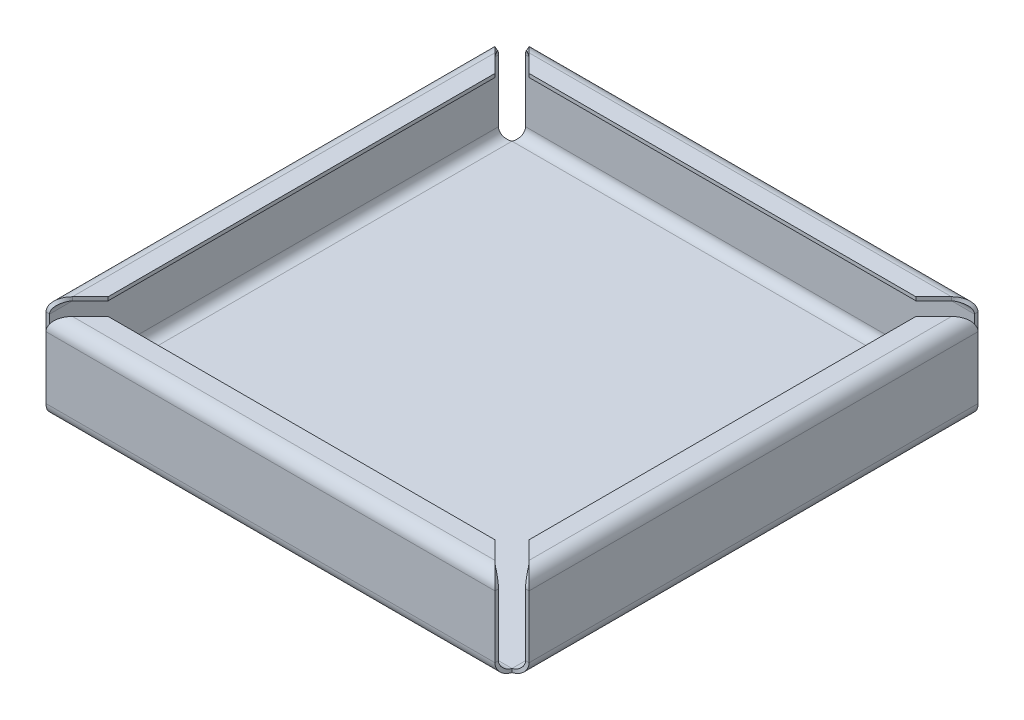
ISO-10303-21;
HEADER;
FILE_DESCRIPTION(('STEP AP214'),'2;1');
FILE_NAME('part.step','',(''),(''),'','','');
FILE_SCHEMA(('AUTOMOTIVE_DESIGN { 1 0 10303 214 1 1 1 1 }'));
ENDSEC;
DATA;
#1=APPLICATION_CONTEXT('core data for automotive mechanical design processes');
#2=APPLICATION_PROTOCOL_DEFINITION('international standard','automotive_design',2000,#1);
#3=PRODUCT_CONTEXT('',#1,'mechanical');
#4=PRODUCT('Part','Part','',(#3));
#5=PRODUCT_RELATED_PRODUCT_CATEGORY('part','',(#4));
#6=PRODUCT_DEFINITION_FORMATION('','',#4);
#7=PRODUCT_DEFINITION_CONTEXT('part definition',#1,'design');
#8=PRODUCT_DEFINITION('design','',#6,#7);
#9=PRODUCT_DEFINITION_SHAPE('','',#8);
#10=(LENGTH_UNIT() NAMED_UNIT(*) SI_UNIT(.MILLI.,.METRE.));
#11=(NAMED_UNIT(*) PLANE_ANGLE_UNIT() SI_UNIT($,.RADIAN.));
#12=(NAMED_UNIT(*) SI_UNIT($,.STERADIAN.) SOLID_ANGLE_UNIT());
#13=UNCERTAINTY_MEASURE_WITH_UNIT(LENGTH_MEASURE(1.E-05),#10,'distance_accuracy_value','');
#14=(GEOMETRIC_REPRESENTATION_CONTEXT(3) GLOBAL_UNCERTAINTY_ASSIGNED_CONTEXT((#13)) GLOBAL_UNIT_ASSIGNED_CONTEXT((#10,
#11,#12)) REPRESENTATION_CONTEXT('',''));
#15=CARTESIAN_POINT('',(0.,0.,0.));
#16=DIRECTION('',(0.,0.,1.));
#17=DIRECTION('',(1.,0.,0.));
#18=AXIS2_PLACEMENT_3D('',#15,#16,#17);
#19=CARTESIAN_POINT('',(-50.,0.,50.));
#20=DIRECTION('',(0.,1.,0.));
#21=DIRECTION('',(0.,0.,1.));
#22=AXIS2_PLACEMENT_3D('',#19,#20,#21);
#23=PLANE('',#22);
#24=DIRECTION('',(0.,0.,-1.));
#25=VECTOR('',#24,1.);
#26=CARTESIAN_POINT('',(47.2634000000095,0.,550.000000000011));
#27=LINE('',#26,#25);
#28=CARTESIAN_POINT('',(47.263399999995,0.,47.2634000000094));
#29=VERTEX_POINT('',#28);
#30=CARTESIAN_POINT('',(47.263399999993,0.,-47.2634000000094));
#31=VERTEX_POINT('',#30);
#32=EDGE_CURVE('E225',#29,#31,#27,.T.);
#33=ORIENTED_EDGE('',*,*,#32,.F.);
#34=DIRECTION('',(1.,0.,0.));
#35=VECTOR('',#34,1.);
#36=CARTESIAN_POINT('',(-50.0000000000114,0.,47.2634000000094));
#37=LINE('',#36,#35);
#38=CARTESIAN_POINT('',(-47.2633999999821,0.,47.2634000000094));
#39=VERTEX_POINT('',#38);
#40=EDGE_CURVE('E431',#39,#29,#37,.T.);
#41=ORIENTED_EDGE('',*,*,#40,.F.);
#42=DIRECTION('',(0.,0.,1.));
#43=VECTOR('',#42,1.);
#44=CARTESIAN_POINT('',(-47.2634000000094,0.,-50.0000000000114));
#45=LINE('',#44,#43);
#46=CARTESIAN_POINT('',(-47.2634000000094,0.,-47.263399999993));
#47=VERTEX_POINT('',#46);
#48=EDGE_CURVE('E327',#47,#39,#45,.T.);
#49=ORIENTED_EDGE('',*,*,#48,.F.);
#50=DIRECTION('',(-1.,0.,0.));
#51=VECTOR('',#50,1.);
#52=CARTESIAN_POINT('',(50.0000000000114,0.,-47.2634000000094));
#53=LINE('',#52,#51);
#54=EDGE_CURVE('E228',#31,#47,#53,.T.);
#55=ORIENTED_EDGE('',*,*,#54,.F.);
#56=EDGE_LOOP('',(#33,#41,#49,#55));
#57=FACE_BOUND('',#56,.T.);
#58=ADVANCED_FACE('F34',(#57),#23,.F.);
#59=CARTESIAN_POINT('',(-50.,0.7366,50.));
#60=DIRECTION('',(0.,1.,0.));
#61=DIRECTION('',(0.,0.,1.));
#62=AXIS2_PLACEMENT_3D('',#59,#60,#61);
#63=PLANE('',#62);
#64=DIRECTION('',(1.,0.,0.));
#65=VECTOR('',#64,1.);
#66=CARTESIAN_POINT('',(-50.0000000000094,0.7366,47.2634000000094));
#67=LINE('',#66,#65);
#68=CARTESIAN_POINT('',(-47.2634000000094,0.7366,47.2634000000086));
#69=VERTEX_POINT('',#68);
#70=CARTESIAN_POINT('',(47.263399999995,0.7366,47.2634000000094));
#71=VERTEX_POINT('',#70);
#72=EDGE_CURVE('E473',#69,#71,#67,.T.);
#73=ORIENTED_EDGE('',*,*,#72,.T.);
#74=DIRECTION('',(0.,0.,-1.));
#75=VECTOR('',#74,1.);
#76=CARTESIAN_POINT('',(47.2634000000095,0.7366,550.000000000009));
#77=LINE('',#76,#75);
#78=CARTESIAN_POINT('',(47.2634000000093,0.7366,-47.2634000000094));
#79=VERTEX_POINT('',#78);
#80=EDGE_CURVE('E213',#71,#79,#77,.T.);
#81=ORIENTED_EDGE('',*,*,#80,.T.);
#82=DIRECTION('',(-1.,0.,0.));
#83=VECTOR('',#82,1.);
#84=CARTESIAN_POINT('',(50.0000000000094,0.7366,-47.2634000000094));
#85=LINE('',#84,#83);
#86=CARTESIAN_POINT('',(-47.2634000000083,0.7366,-47.2634000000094));
#87=VERTEX_POINT('',#86);
#88=EDGE_CURVE('E241',#79,#87,#85,.T.);
#89=ORIENTED_EDGE('',*,*,#88,.T.);
#90=DIRECTION('',(0.,0.,1.));
#91=VECTOR('',#90,1.);
#92=CARTESIAN_POINT('',(-47.2634000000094,0.7366,-50.0000000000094));
#93=LINE('',#92,#91);
#94=EDGE_CURVE('E343',#87,#69,#93,.T.);
#95=ORIENTED_EDGE('',*,*,#94,.T.);
#96=EDGE_LOOP('',(#73,#81,#89,#95));
#97=FACE_BOUND('',#96,.T.);
#98=ADVANCED_FACE('F36',(#97),#63,.T.);
#99=CARTESIAN_POINT('',(50.,15.6154704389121,46.4644660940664));
#100=DIRECTION('',(0.,7.2608460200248E-13,1.));
#101=DIRECTION('',(7.2608460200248E-13,-1.,7.26084602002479E-13));
#102=AXIS2_PLACEMENT_3D('',#99,#100,#101);
#103=PLANE('',#102);
#104=DIRECTION('',(-1.,-7.26084602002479E-13,0.));
#105=VECTOR('',#104,1.);
#106=CARTESIAN_POINT('',(50.0000000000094,2.73660000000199,46.4644660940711));
#107=LINE('',#106,#105);
#108=CARTESIAN_POINT('',(50.0000000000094,2.73660000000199,46.4644660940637));
#109=VERTEX_POINT('',#108);
#110=CARTESIAN_POINT('',(49.2634000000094,2.73660000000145,46.4644660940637));
#111=VERTEX_POINT('',#110);
#112=EDGE_CURVE('E11',#109,#111,#107,.T.);
#113=ORIENTED_EDGE('',*,*,#112,.F.);
#114=DIRECTION('',(7.2608460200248E-13,-1.,7.26084602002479E-13));
#115=VECTOR('',#114,1.);
#116=CARTESIAN_POINT('',(50.,15.6154704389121,46.4644660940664));
#117=LINE('',#116,#115);
#118=CARTESIAN_POINT('',(50.,15.6154704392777,46.4644660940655));
#119=VERTEX_POINT('',#118);
#120=EDGE_CURVE('E88',#119,#109,#117,.T.);
#121=ORIENTED_EDGE('',*,*,#120,.F.);
#122=DIRECTION('',(-1.,0.,0.));
#123=VECTOR('',#122,1.);
#124=CARTESIAN_POINT('',(50.,15.6154704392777,46.4644660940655));
#125=LINE('',#124,#123);
#126=CARTESIAN_POINT('',(49.2634,15.6154704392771,46.4644660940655));
#127=VERTEX_POINT('',#126);
#128=EDGE_CURVE('E43',#119,#127,#125,.T.);
#129=ORIENTED_EDGE('',*,*,#128,.T.);
#130=DIRECTION('',(-7.26084602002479E-13,1.,0.));
#131=VECTOR('',#130,1.);
#132=CARTESIAN_POINT('',(49.2634,15.6154704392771,46.4644660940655));
#133=LINE('',#132,#131);
#134=EDGE_CURVE('E85',#127,#111,#133,.F.);
#135=ORIENTED_EDGE('',*,*,#134,.T.);
#136=EDGE_LOOP('',(#113,#121,#129,#135));
#137=FACE_BOUND('',#136,.T.);
#138=ADVANCED_FACE('F83',(#137),#103,.T.);
#139=CARTESIAN_POINT('',(45.2634,15.6154704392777,40.9912660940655));
#140=CARTESIAN_POINT('',(45.0178666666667,15.6154704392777,40.9912660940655));
#141=CARTESIAN_POINT('',(44.7723333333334,15.6154704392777,40.9912660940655));
#142=CARTESIAN_POINT('',(44.5268,15.6154704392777,40.9912660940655));
#143=CARTESIAN_POINT('',(45.2634,11.6154704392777,40.9912660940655));
#144=CARTESIAN_POINT('',(45.0178666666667,11.124403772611,40.9912660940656));
#145=CARTESIAN_POINT('',(44.7723333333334,10.6333371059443,40.9912660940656));
#146=CARTESIAN_POINT('',(44.5268,10.1422704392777,40.9912660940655));
#147=CARTESIAN_POINT('',(49.2634,11.6154704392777,46.4644660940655));
#148=CARTESIAN_POINT('',(49.5089333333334,11.124403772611,46.4644660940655));
#149=CARTESIAN_POINT('',(49.7544666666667,10.6333371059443,46.4644660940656));
#150=CARTESIAN_POINT('',(50.,10.1422704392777,46.4644660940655));
#151=CARTESIAN_POINT('',(49.2634,15.6154704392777,46.4644660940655));
#152=CARTESIAN_POINT('',(49.5089333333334,15.6154704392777,46.4644660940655));
#153=CARTESIAN_POINT('',(49.7544666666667,15.6154704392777,46.4644660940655));
#154=CARTESIAN_POINT('',(50.,15.6154704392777,46.4644660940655));
#155=CARTESIAN_POINT('',(49.2634,19.6154704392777,46.4644660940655));
#156=CARTESIAN_POINT('',(49.5089333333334,20.1065371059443,46.4644660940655));
#157=CARTESIAN_POINT('',(49.7544666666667,20.597603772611,46.4644660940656));
#158=CARTESIAN_POINT('',(50.,21.0886704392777,46.4644660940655));
#159=CARTESIAN_POINT('',(45.2634,19.6154704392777,40.9912660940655));
#160=CARTESIAN_POINT('',(45.0178666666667,20.1065371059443,40.9912660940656));
#161=CARTESIAN_POINT('',(44.7723333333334,20.597603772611,40.9912660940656));
#162=CARTESIAN_POINT('',(44.5268,21.0886704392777,40.9912660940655));
#163=CARTESIAN_POINT('',(45.2634,15.6154704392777,40.9912660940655));
#164=CARTESIAN_POINT('',(45.0178666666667,15.6154704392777,40.9912660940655));
#165=CARTESIAN_POINT('',(44.7723333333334,15.6154704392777,40.9912660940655));
#166=CARTESIAN_POINT('',(44.5268,15.6154704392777,40.9912660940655));
#167=(BOUNDED_SURFACE() B_SPLINE_SURFACE(3,3,((#139,#140,#141,#142),(#143,#144,#145,#146),(#147,
#148,#149,#150),(#151,#152,#153,#154),(#155,#156,#157,#158),(#159,#160,#161,#162),(#163,#164,
#165,#166)),.UNSPECIFIED.,.T.,.F.,.F.) B_SPLINE_SURFACE_WITH_KNOTS((4,3,4),(4,4),(0.,0.5,1.),
(0.,1.),.UNSPECIFIED.) GEOMETRIC_REPRESENTATION_ITEM() RATIONAL_B_SPLINE_SURFACE(((1.,1.,1.,1.),
(0.333333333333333,0.333333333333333,0.333333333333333,0.333333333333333),(0.333333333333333,
0.333333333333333,0.333333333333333,0.333333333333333),(1.,1.,1.,1.),(0.333333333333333,
0.333333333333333,0.333333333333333,0.333333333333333),(0.333333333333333,0.333333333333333,
0.333333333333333,0.333333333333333),(1.,1.,1.,1.))) REPRESENTATION_ITEM('') SURFACE());
#168=CARTESIAN_POINT('',(47.2634,15.6154704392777,43.7278660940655));
#169=DIRECTION('',(-0.707106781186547,0.,0.707106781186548));
#170=DIRECTION('',(-0.707106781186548,0.,-0.707106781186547));
#171=AXIS2_PLACEMENT_3D('',#168,#169,#170);
#172=ELLIPSE('',#171,3.87013683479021,2.7366);
#173=CARTESIAN_POINT('',(47.2634,18.3520704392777,43.7278660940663));
#174=VERTEX_POINT('',#173);
#175=EDGE_CURVE('E178',#119,#174,#172,.T.);
#176=DIRECTION('',(0.,-1.,0.));
#177=VECTOR('',#176,1.);
#178=CARTESIAN_POINT('',(47.2634,18.3520704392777,43.7278660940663));
#179=LINE('',#178,#177);
#180=CARTESIAN_POINT('',(47.2634,17.6154704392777,43.7278660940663));
#181=VERTEX_POINT('',#180);
#182=EDGE_CURVE('E93',#174,#181,#179,.T.);
#183=CARTESIAN_POINT('',(47.2634,15.6154704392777,43.7278660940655));
#184=DIRECTION('',(-0.807366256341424,0.,0.590050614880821));
#185=DIRECTION('',(-0.590050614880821,0.,-0.807366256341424));
#186=AXIS2_PLACEMENT_3D('',#183,#184,#185);
#187=ELLIPSE('',#186,3.38953972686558,2.);
#188=EDGE_CURVE('E105',#127,#181,#187,.T.);
#189=ORIENTED_EDGE('',*,*,#128,.F.);
#190=ORIENTED_EDGE('',*,*,#175,.T.);
#191=ORIENTED_EDGE('',*,*,#182,.T.);
#192=ORIENTED_EDGE('',*,*,#188,.F.);
#193=EDGE_LOOP('',(#189,#190,#191,#192));
#194=FACE_BOUND('',#193,.T.);
#195=ADVANCED_FACE('F108',(#194),#167,.F.);
#196=CARTESIAN_POINT('',(301.767766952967,18.3520704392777,298.232233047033));
#197=DIRECTION('',(-0.707106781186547,0.,0.707106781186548));
#198=DIRECTION('',(-0.707106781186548,0.,-0.707106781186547));
#199=AXIS2_PLACEMENT_3D('',#196,#197,#198);
#200=PLANE('',#199);
#201=ORIENTED_EDGE('',*,*,#182,.F.);
#202=DIRECTION('',(-0.707106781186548,0.,-0.707106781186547));
#203=VECTOR('',#202,1.);
#204=CARTESIAN_POINT('',(301.767766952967,18.3520704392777,298.232233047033));
#205=LINE('',#204,#203);
#206=CARTESIAN_POINT('',(43.5707743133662,18.3520704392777,40.0352404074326));
#207=VERTEX_POINT('',#206);
#208=EDGE_CURVE('E151',#174,#207,#205,.T.);
#209=ORIENTED_EDGE('',*,*,#208,.T.);
#210=DIRECTION('',(0.,-1.,0.));
#211=VECTOR('',#210,1.);
#212=CARTESIAN_POINT('',(43.5707743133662,18.3520704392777,40.0352404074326));
#213=LINE('',#212,#211);
#214=CARTESIAN_POINT('',(43.5707743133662,17.6154704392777,40.0352404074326));
#215=VERTEX_POINT('',#214);
#216=EDGE_CURVE('E142',#207,#215,#213,.T.);
#217=ORIENTED_EDGE('',*,*,#216,.T.);
#218=DIRECTION('',(-0.707106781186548,0.,-0.707106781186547));
#219=VECTOR('',#218,1.);
#220=CARTESIAN_POINT('',(301.767766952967,17.6154704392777,298.232233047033));
#221=LINE('',#220,#219);
#222=EDGE_CURVE('E113',#181,#215,#221,.T.);
#223=ORIENTED_EDGE('',*,*,#222,.F.);
#224=EDGE_LOOP('',(#201,#209,#217,#223));
#225=FACE_BOUND('',#224,.T.);
#226=ADVANCED_FACE('F147',(#225),#200,.T.);
#227=CARTESIAN_POINT('',(43.5707743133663,18.3520704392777,550.));
#228=DIRECTION('',(-1.,0.,0.));
#229=DIRECTION('',(0.,0.,-1.));
#230=AXIS2_PLACEMENT_3D('',#227,#228,#229);
#231=PLANE('',#230);
#232=ORIENTED_EDGE('',*,*,#216,.F.);
#233=DIRECTION('',(0.,0.,-1.));
#234=VECTOR('',#233,1.);
#235=CARTESIAN_POINT('',(43.5707743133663,18.3520704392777,550.));
#236=LINE('',#235,#234);
#237=CARTESIAN_POINT('',(43.5707743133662,18.3520704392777,-40.0352404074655));
#238=VERTEX_POINT('',#237);
#239=EDGE_CURVE('E162',#207,#238,#236,.T.);
#240=ORIENTED_EDGE('',*,*,#239,.T.);
#241=DIRECTION('',(0.,-1.,0.));
#242=VECTOR('',#241,1.);
#243=CARTESIAN_POINT('',(43.5707743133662,18.3520704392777,-40.0352404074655));
#244=LINE('',#243,#242);
#245=CARTESIAN_POINT('',(43.5707743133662,17.6154704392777,-40.0352404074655));
#246=VERTEX_POINT('',#245);
#247=EDGE_CURVE('E140',#238,#246,#244,.T.);
#248=ORIENTED_EDGE('',*,*,#247,.T.);
#249=DIRECTION('',(0.,0.,-1.));
#250=VECTOR('',#249,1.);
#251=CARTESIAN_POINT('',(43.5707743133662,17.6154704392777,550.));
#252=LINE('',#251,#250);
#253=EDGE_CURVE('E118',#215,#246,#252,.T.);
#254=ORIENTED_EDGE('',*,*,#253,.F.);
#255=EDGE_LOOP('',(#232,#240,#248,#254));
#256=FACE_BOUND('',#255,.T.);
#257=ADVANCED_FACE('F159',(#256),#231,.T.);
#258=CARTESIAN_POINT('',(-248.23223304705,18.3520704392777,251.76776695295));
#259=DIRECTION('',(-0.707106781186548,0.,-0.707106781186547));
#260=DIRECTION('',(0.707106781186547,0.,-0.707106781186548));
#261=AXIS2_PLACEMENT_3D('',#258,#259,#260);
#262=PLANE('',#261);
#263=ORIENTED_EDGE('',*,*,#247,.F.);
#264=DIRECTION('',(0.707106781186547,0.,-0.707106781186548));
#265=VECTOR('',#264,1.);
#266=CARTESIAN_POINT('',(-248.23223304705,18.3520704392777,251.76776695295));
#267=LINE('',#266,#265);
#268=CARTESIAN_POINT('',(47.2634,18.3520704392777,-43.7278660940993));
#269=VERTEX_POINT('',#268);
#270=EDGE_CURVE('E126',#238,#269,#267,.T.);
#271=ORIENTED_EDGE('',*,*,#270,.T.);
#272=DIRECTION('',(0.,-1.,0.));
#273=VECTOR('',#272,1.);
#274=CARTESIAN_POINT('',(47.2634,18.3520704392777,-43.7278660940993));
#275=LINE('',#274,#273);
#276=CARTESIAN_POINT('',(47.2634,17.6154704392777,-43.7278660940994));
#277=VERTEX_POINT('',#276);
#278=EDGE_CURVE('E138',#269,#277,#275,.T.);
#279=ORIENTED_EDGE('',*,*,#278,.T.);
#280=DIRECTION('',(0.707106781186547,0.,-0.707106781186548));
#281=VECTOR('',#280,1.);
#282=CARTESIAN_POINT('',(-248.23223304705,17.6154704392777,251.76776695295));
#283=LINE('',#282,#281);
#284=EDGE_CURVE('E104',#246,#277,#283,.T.);
#285=ORIENTED_EDGE('',*,*,#284,.F.);
#286=EDGE_LOOP('',(#263,#271,#279,#285));
#287=FACE_BOUND('',#286,.T.);
#288=ADVANCED_FACE('F166',(#287),#262,.T.);
#289=CARTESIAN_POINT('',(49.2634,15.6154704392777,-46.4644660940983));
#290=CARTESIAN_POINT('',(49.5089333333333,15.6154704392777,-46.4644660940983));
#291=CARTESIAN_POINT('',(49.7544666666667,15.6154704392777,-46.4644660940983));
#292=CARTESIAN_POINT('',(50.,15.6154704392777,-46.4644660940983));
#293=CARTESIAN_POINT('',(49.2634,11.6154704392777,-46.4644660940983));
#294=CARTESIAN_POINT('',(49.5089333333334,11.124403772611,-46.4644660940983));
#295=CARTESIAN_POINT('',(49.7544666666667,10.6333371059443,-46.4644660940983));
#296=CARTESIAN_POINT('',(50.,10.1422704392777,-46.4644660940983));
#297=CARTESIAN_POINT('',(45.2634,11.6154704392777,-40.9912660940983));
#298=CARTESIAN_POINT('',(45.0178666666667,11.124403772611,-40.9912660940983));
#299=CARTESIAN_POINT('',(44.7723333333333,10.6333371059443,-40.9912660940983));
#300=CARTESIAN_POINT('',(44.5268,10.1422704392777,-40.9912660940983));
#301=CARTESIAN_POINT('',(45.2634,15.6154704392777,-40.9912660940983));
#302=CARTESIAN_POINT('',(45.0178666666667,15.6154704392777,-40.9912660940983));
#303=CARTESIAN_POINT('',(44.7723333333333,15.6154704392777,-40.9912660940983));
#304=CARTESIAN_POINT('',(44.5268,15.6154704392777,-40.9912660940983));
#305=CARTESIAN_POINT('',(45.2634,19.6154704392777,-40.9912660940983));
#306=CARTESIAN_POINT('',(45.0178666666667,20.1065371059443,-40.9912660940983));
#307=CARTESIAN_POINT('',(44.7723333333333,20.597603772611,-40.9912660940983));
#308=CARTESIAN_POINT('',(44.5268,21.0886704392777,-40.9912660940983));
#309=CARTESIAN_POINT('',(49.2634,19.6154704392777,-46.4644660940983));
#310=CARTESIAN_POINT('',(49.5089333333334,20.1065371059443,-46.4644660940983));
#311=CARTESIAN_POINT('',(49.7544666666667,20.597603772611,-46.4644660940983));
#312=CARTESIAN_POINT('',(50.,21.0886704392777,-46.4644660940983));
#313=CARTESIAN_POINT('',(49.2634,15.6154704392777,-46.4644660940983));
#314=CARTESIAN_POINT('',(49.5089333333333,15.6154704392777,-46.4644660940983));
#315=CARTESIAN_POINT('',(49.7544666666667,15.6154704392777,-46.4644660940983));
#316=CARTESIAN_POINT('',(50.,15.6154704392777,-46.4644660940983));
#317=(BOUNDED_SURFACE() B_SPLINE_SURFACE(3,3,((#289,#290,#291,#292),(#293,#294,#295,#296),(#297,
#298,#299,#300),(#301,#302,#303,#304),(#305,#306,#307,#308),(#309,#310,#311,#312),(#313,#314,
#315,#316)),.UNSPECIFIED.,.T.,.F.,.F.) B_SPLINE_SURFACE_WITH_KNOTS((4,3,4),(4,4),(0.,0.5,1.),
(0.,1.),.UNSPECIFIED.) GEOMETRIC_REPRESENTATION_ITEM() RATIONAL_B_SPLINE_SURFACE(((1.,1.,1.,1.),
(0.333333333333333,0.333333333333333,0.333333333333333,0.333333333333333),(0.333333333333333,
0.333333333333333,0.333333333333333,0.333333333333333),(1.,1.,1.,1.),(0.333333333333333,
0.333333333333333,0.333333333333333,0.333333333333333),(0.333333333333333,0.333333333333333,
0.333333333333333,0.333333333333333),(1.,1.,1.,1.))) REPRESENTATION_ITEM('') SURFACE());
#318=CARTESIAN_POINT('',(47.2634,15.6154704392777,-43.7278660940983));
#319=DIRECTION('',(-0.707106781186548,0.,-0.707106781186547));
#320=DIRECTION('',(0.707106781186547,0.,-0.707106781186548));
#321=AXIS2_PLACEMENT_3D('',#318,#319,#320);
#322=ELLIPSE('',#321,3.87013683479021,2.7366);
#323=CARTESIAN_POINT('',(50.,15.6154704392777,-46.4644660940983));
#324=VERTEX_POINT('',#323);
#325=EDGE_CURVE('E176',#269,#324,#322,.T.);
#326=DIRECTION('',(-1.,-7.26084602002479E-13,0.));
#327=VECTOR('',#326,1.);
#328=CARTESIAN_POINT('',(50.,15.6154704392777,-46.4644660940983));
#329=LINE('',#328,#327);
#330=CARTESIAN_POINT('',(49.2634,15.6154704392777,-46.4644660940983));
#331=VERTEX_POINT('',#330);
#332=EDGE_CURVE('E59',#324,#331,#329,.T.);
#333=CARTESIAN_POINT('',(47.2634,15.6154704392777,-43.7278660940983));
#334=DIRECTION('',(-0.807366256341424,0.,-0.590050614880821));
#335=DIRECTION('',(0.590050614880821,0.,-0.807366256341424));
#336=AXIS2_PLACEMENT_3D('',#333,#334,#335);
#337=ELLIPSE('',#336,3.38953972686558,2.);
#338=EDGE_CURVE('E116',#277,#331,#337,.T.);
#339=ORIENTED_EDGE('',*,*,#278,.F.);
#340=ORIENTED_EDGE('',*,*,#325,.T.);
#341=ORIENTED_EDGE('',*,*,#332,.T.);
#342=ORIENTED_EDGE('',*,*,#338,.F.);
#343=EDGE_LOOP('',(#339,#340,#341,#342));
#344=FACE_BOUND('',#343,.T.);
#345=ADVANCED_FACE('F642',(#344),#317,.F.);
#346=CARTESIAN_POINT('',(50.,15.6154704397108,-46.4644660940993));
#347=DIRECTION('',(0.,7.26084602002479E-13,-1.));
#348=DIRECTION('',(-7.26084602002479E-13,1.,7.26084602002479E-13));
#349=AXIS2_PLACEMENT_3D('',#346,#347,#348);
#350=PLANE('',#349);
#351=ORIENTED_EDGE('',*,*,#332,.F.);
#352=DIRECTION('',(-7.26084602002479E-13,1.,7.26084602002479E-13));
#353=VECTOR('',#352,1.);
#354=CARTESIAN_POINT('',(50.,15.6154704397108,-46.4644660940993));
#355=LINE('',#354,#353);
#356=CARTESIAN_POINT('',(50.0000000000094,2.73660000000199,-46.4644660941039));
#357=VERTEX_POINT('',#356);
#358=EDGE_CURVE('E129',#357,#324,#355,.T.);
#359=ORIENTED_EDGE('',*,*,#358,.F.);
#360=DIRECTION('',(-1.,-7.26084602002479E-13,0.));
#361=VECTOR('',#360,1.);
#362=CARTESIAN_POINT('',(50.0000000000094,2.73660000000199,-46.4644660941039));
#363=LINE('',#362,#361);
#364=CARTESIAN_POINT('',(49.2634000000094,2.73660000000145,-46.4644660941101));
#365=VERTEX_POINT('',#364);
#366=EDGE_CURVE('E38',#357,#365,#363,.T.);
#367=ORIENTED_EDGE('',*,*,#366,.T.);
#368=DIRECTION('',(-7.26084602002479E-13,1.,0.));
#369=VECTOR('',#368,1.);
#370=CARTESIAN_POINT('',(49.2634,15.6154704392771,-46.4644660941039));
#371=LINE('',#370,#369);
#372=EDGE_CURVE('E130',#365,#331,#371,.T.);
#373=ORIENTED_EDGE('',*,*,#372,.T.);
#374=EDGE_LOOP('',(#351,#359,#367,#373));
#375=FACE_BOUND('',#374,.T.);
#376=ADVANCED_FACE('F203',(#375),#350,.T.);
#377=CARTESIAN_POINT('',(49.2634000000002,15.6154704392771,550.));
#378=DIRECTION('',(1.,7.26084602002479E-13,0.));
#379=DIRECTION('',(-7.26084602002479E-13,1.,0.));
#380=AXIS2_PLACEMENT_3D('',#377,#378,#379);
#381=PLANE('',#380);
#382=ORIENTED_EDGE('',*,*,#372,.F.);
#383=DIRECTION('',(0.,0.,1.));
#384=VECTOR('',#383,1.);
#385=CARTESIAN_POINT('',(49.2634000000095,2.73660000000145,550.));
#386=LINE('',#385,#384);
#387=EDGE_CURVE('E103',#111,#365,#386,.F.);
#388=ORIENTED_EDGE('',*,*,#387,.F.);
#389=ORIENTED_EDGE('',*,*,#134,.F.);
#390=DIRECTION('',(0.,0.,1.));
#391=VECTOR('',#390,1.);
#392=CARTESIAN_POINT('',(49.2634000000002,15.6154704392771,550.));
#393=LINE('',#392,#391);
#394=EDGE_CURVE('E101',#127,#331,#393,.F.);
#395=ORIENTED_EDGE('',*,*,#394,.T.);
#396=EDGE_LOOP('',(#382,#388,#389,#395));
#397=FACE_BOUND('',#396,.T.);
#398=ADVANCED_FACE('F99',(#397),#381,.F.);
#399=CARTESIAN_POINT('',(47.2634000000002,15.6154704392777,550.));
#400=DIRECTION('',(0.,0.,-1.));
#401=DIRECTION('',(-1.,0.,0.));
#402=AXIS2_PLACEMENT_3D('',#399,#400,#401);
#403=CYLINDRICAL_SURFACE('',#402,2.);
#404=DIRECTION('',(0.,0.,-1.));
#405=VECTOR('',#404,1.);
#406=CARTESIAN_POINT('',(47.2634000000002,17.6154704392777,550.));
#407=LINE('',#406,#405);
#408=EDGE_CURVE('E122',#181,#277,#407,.T.);
#409=ORIENTED_EDGE('',*,*,#408,.T.);
#410=ORIENTED_EDGE('',*,*,#338,.T.);
#411=ORIENTED_EDGE('',*,*,#394,.F.);
#412=ORIENTED_EDGE('',*,*,#188,.T.);
#413=EDGE_LOOP('',(#409,#410,#411,#412));
#414=FACE_BOUND('',#413,.T.);
#415=ADVANCED_FACE('F115',(#414),#403,.F.);
#416=CARTESIAN_POINT('',(50.0000000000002,17.6154704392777,550.));
#417=DIRECTION('',(0.,-1.,0.));
#418=DIRECTION('',(0.,0.,-1.));
#419=AXIS2_PLACEMENT_3D('',#416,#417,#418);
#420=PLANE('',#419);
#421=ORIENTED_EDGE('',*,*,#253,.T.);
#422=ORIENTED_EDGE('',*,*,#284,.T.);
#423=ORIENTED_EDGE('',*,*,#408,.F.);
#424=ORIENTED_EDGE('',*,*,#222,.T.);
#425=EDGE_LOOP('',(#421,#422,#423,#424));
#426=FACE_BOUND('',#425,.T.);
#427=ADVANCED_FACE('F157',(#426),#420,.T.);
#428=CARTESIAN_POINT('',(50.0000000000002,15.6154704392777,550.));
#429=DIRECTION('',(1.,7.26084602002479E-13,0.));
#430=DIRECTION('',(-7.26084602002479E-13,1.,0.));
#431=AXIS2_PLACEMENT_3D('',#428,#429,#430);
#432=PLANE('',#431);
#433=ORIENTED_EDGE('',*,*,#358,.T.);
#434=DIRECTION('',(0.,0.,-1.));
#435=VECTOR('',#434,1.);
#436=CARTESIAN_POINT('',(50.0000000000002,15.6154704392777,550.));
#437=LINE('',#436,#435);
#438=EDGE_CURVE('E187',#119,#324,#437,.T.);
#439=ORIENTED_EDGE('',*,*,#438,.F.);
#440=ORIENTED_EDGE('',*,*,#120,.T.);
#441=DIRECTION('',(0.,0.,-1.));
#442=VECTOR('',#441,1.);
#443=CARTESIAN_POINT('',(50.0000000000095,2.73660000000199,550.000000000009));
#444=LINE('',#443,#442);
#445=EDGE_CURVE('E192',#109,#357,#444,.T.);
#446=ORIENTED_EDGE('',*,*,#445,.T.);
#447=EDGE_LOOP('',(#433,#439,#440,#446));
#448=FACE_BOUND('',#447,.T.);
#449=ADVANCED_FACE('F196',(#448),#432,.T.);
#450=CARTESIAN_POINT('',(47.2634000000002,15.6154704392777,550.));
#451=DIRECTION('',(0.,0.,-1.));
#452=DIRECTION('',(-1.,0.,0.));
#453=AXIS2_PLACEMENT_3D('',#450,#451,#452);
#454=CYLINDRICAL_SURFACE('',#453,2.7366);
#455=DIRECTION('',(0.,0.,-1.));
#456=VECTOR('',#455,1.);
#457=CARTESIAN_POINT('',(47.2634000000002,18.3520704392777,550.));
#458=LINE('',#457,#456);
#459=EDGE_CURVE('E174',#174,#269,#458,.T.);
#460=ORIENTED_EDGE('',*,*,#459,.F.);
#461=ORIENTED_EDGE('',*,*,#175,.F.);
#462=ORIENTED_EDGE('',*,*,#438,.T.);
#463=ORIENTED_EDGE('',*,*,#325,.F.);
#464=EDGE_LOOP('',(#460,#461,#462,#463));
#465=FACE_BOUND('',#464,.T.);
#466=ADVANCED_FACE('F644',(#465),#454,.T.);
#467=CARTESIAN_POINT('',(50.0000000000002,18.3520704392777,550.));
#468=DIRECTION('',(0.,-1.,0.));
#469=DIRECTION('',(0.,0.,-1.));
#470=AXIS2_PLACEMENT_3D('',#467,#468,#469);
#471=PLANE('',#470);
#472=ORIENTED_EDGE('',*,*,#239,.F.);
#473=ORIENTED_EDGE('',*,*,#208,.F.);
#474=ORIENTED_EDGE('',*,*,#459,.T.);
#475=ORIENTED_EDGE('',*,*,#270,.F.);
#476=EDGE_LOOP('',(#472,#473,#474,#475));
#477=FACE_BOUND('',#476,.T.);
#478=ADVANCED_FACE('F172',(#477),#471,.F.);
#479=CARTESIAN_POINT('',(50.0000000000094,2.7366,46.4644660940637));
#480=CARTESIAN_POINT('',(49.7544666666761,2.7366,46.4644660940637));
#481=CARTESIAN_POINT('',(49.5089333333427,2.7366,46.4644660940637));
#482=CARTESIAN_POINT('',(49.2634000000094,2.7366,46.4644660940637));
#483=CARTESIAN_POINT('',(50.0000000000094,-2.7366,46.4644660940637));
#484=CARTESIAN_POINT('',(49.7544666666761,-2.24553333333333,46.4644660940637));
#485=CARTESIAN_POINT('',(49.5089333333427,-1.75446666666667,46.4644660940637));
#486=CARTESIAN_POINT('',(49.2634000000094,-1.2634,46.4644660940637));
#487=CARTESIAN_POINT('',(44.5268000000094,-2.7366,48.0623339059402));
#488=CARTESIAN_POINT('',(44.7723333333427,-2.24553333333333,48.0623339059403));
#489=CARTESIAN_POINT('',(45.0178666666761,-1.75446666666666,48.0623339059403));
#490=CARTESIAN_POINT('',(45.2634000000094,-1.2634,48.0623339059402));
#491=CARTESIAN_POINT('',(44.5268000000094,2.7366,48.0623339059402));
#492=CARTESIAN_POINT('',(44.7723333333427,2.7366,48.0623339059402));
#493=CARTESIAN_POINT('',(45.017866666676,2.7366,48.0623339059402));
#494=CARTESIAN_POINT('',(45.2634000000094,2.7366,48.0623339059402));
#495=CARTESIAN_POINT('',(44.5268000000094,8.2098,48.0623339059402));
#496=CARTESIAN_POINT('',(44.7723333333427,7.71873333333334,48.0623339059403));
#497=CARTESIAN_POINT('',(45.0178666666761,7.22766666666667,48.0623339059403));
#498=CARTESIAN_POINT('',(45.2634000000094,6.7366,48.0623339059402));
#499=CARTESIAN_POINT('',(50.0000000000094,8.2098,46.4644660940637));
#500=CARTESIAN_POINT('',(49.7544666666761,7.71873333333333,46.4644660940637));
#501=CARTESIAN_POINT('',(49.5089333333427,7.22766666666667,46.4644660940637));
#502=CARTESIAN_POINT('',(49.2634000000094,6.7366,46.4644660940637));
#503=CARTESIAN_POINT('',(50.0000000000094,2.7366,46.4644660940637));
#504=CARTESIAN_POINT('',(49.7544666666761,2.7366,46.4644660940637));
#505=CARTESIAN_POINT('',(49.5089333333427,2.7366,46.4644660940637));
#506=CARTESIAN_POINT('',(49.2634000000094,2.7366,46.4644660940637));
#507=(BOUNDED_SURFACE() B_SPLINE_SURFACE(3,3,((#479,#480,#481,#482),(#483,#484,#485,#486),(#487,
#488,#489,#490),(#491,#492,#493,#494),(#495,#496,#497,#498),(#499,#500,#501,#502),(#503,#504,
#505,#506)),.UNSPECIFIED.,.T.,.F.,.F.) B_SPLINE_SURFACE_WITH_KNOTS((4,3,4),(4,4),(0.,0.5,1.),
(0.,1.),.UNSPECIFIED.) GEOMETRIC_REPRESENTATION_ITEM() RATIONAL_B_SPLINE_SURFACE(((1.,1.,1.,1.),
(0.333333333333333,0.333333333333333,0.333333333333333,0.333333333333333),(0.333333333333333,
0.333333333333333,0.333333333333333,0.333333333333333),(1.,1.,1.,1.),(0.333333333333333,
0.333333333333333,0.333333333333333,0.333333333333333),(0.333333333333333,0.333333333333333,
0.333333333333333,0.333333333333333),(1.,1.,1.,1.))) REPRESENTATION_ITEM('') SURFACE());
#508=DIRECTION('',(0.,1.,0.));
#509=VECTOR('',#508,1.);
#510=CARTESIAN_POINT('',(47.2634000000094,0.,47.263400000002));
#511=LINE('',#510,#509);
#512=EDGE_CURVE('E189',#29,#71,#511,.T.);
#513=CARTESIAN_POINT('',(47.2634000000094,2.7366,47.263400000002));
#514=DIRECTION('',(0.280245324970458,0.,0.959928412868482));
#515=DIRECTION('',(0.959928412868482,0.,-0.280245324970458));
#516=AXIS2_PLACEMENT_3D('',#513,#514,#515);
#517=ELLIPSE('',#516,2.85083758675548,2.7366);
#518=EDGE_CURVE('E223',#109,#29,#517,.F.);
#519=CARTESIAN_POINT('',(47.2634000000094,2.7366,47.263400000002));
#520=DIRECTION('',(0.370963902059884,0.,0.928647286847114));
#521=DIRECTION('',(0.928647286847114,0.,-0.370963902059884));
#522=AXIS2_PLACEMENT_3D('',#519,#520,#521);
#523=ELLIPSE('',#522,2.15367021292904,2.);
#524=EDGE_CURVE('E216',#111,#71,#523,.F.);
#525=ORIENTED_EDGE('',*,*,#512,.F.);
#526=ORIENTED_EDGE('',*,*,#518,.F.);
#527=ORIENTED_EDGE('',*,*,#112,.T.);
#528=ORIENTED_EDGE('',*,*,#524,.T.);
#529=EDGE_LOOP('',(#525,#526,#527,#528));
#530=FACE_BOUND('',#529,.T.);
#531=ADVANCED_FACE('F557',(#530),#507,.F.);
#532=CARTESIAN_POINT('',(44.5268000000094,2.7366,-48.0623339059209));
#533=CARTESIAN_POINT('',(44.7723333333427,2.7366,-48.0623339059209));
#534=CARTESIAN_POINT('',(45.017866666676,2.7366,-48.0623339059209));
#535=CARTESIAN_POINT('',(45.2634000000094,2.7366,-48.0623339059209));
#536=CARTESIAN_POINT('',(44.5268000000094,-2.7366,-48.0623339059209));
#537=CARTESIAN_POINT('',(44.7723333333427,-2.24553333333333,-48.062333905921));
#538=CARTESIAN_POINT('',(45.017866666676,-1.75446666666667,-48.062333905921));
#539=CARTESIAN_POINT('',(45.2634000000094,-1.2634,-48.062333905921));
#540=CARTESIAN_POINT('',(50.0000000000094,-2.7366,-46.4644660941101));
#541=CARTESIAN_POINT('',(49.754466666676,-2.24553333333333,-46.4644660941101));
#542=CARTESIAN_POINT('',(49.5089333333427,-1.75446666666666,-46.4644660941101));
#543=CARTESIAN_POINT('',(49.2634000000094,-1.2634,-46.4644660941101));
#544=CARTESIAN_POINT('',(50.0000000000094,2.7366,-46.4644660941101));
#545=CARTESIAN_POINT('',(49.754466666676,2.7366,-46.4644660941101));
#546=CARTESIAN_POINT('',(49.5089333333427,2.7366,-46.4644660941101));
#547=CARTESIAN_POINT('',(49.2634000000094,2.7366,-46.4644660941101));
#548=CARTESIAN_POINT('',(50.0000000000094,8.2098,-46.4644660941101));
#549=CARTESIAN_POINT('',(49.754466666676,7.71873333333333,-46.4644660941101));
#550=CARTESIAN_POINT('',(49.5089333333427,7.22766666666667,-46.4644660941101));
#551=CARTESIAN_POINT('',(49.2634000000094,6.7366,-46.4644660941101));
#552=CARTESIAN_POINT('',(44.5268000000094,8.2098,-48.0623339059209));
#553=CARTESIAN_POINT('',(44.7723333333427,7.71873333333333,-48.062333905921));
#554=CARTESIAN_POINT('',(45.017866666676,7.22766666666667,-48.062333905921));
#555=CARTESIAN_POINT('',(45.2634000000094,6.7366,-48.062333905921));
#556=CARTESIAN_POINT('',(44.5268000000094,2.7366,-48.0623339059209));
#557=CARTESIAN_POINT('',(44.7723333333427,2.7366,-48.0623339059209));
#558=CARTESIAN_POINT('',(45.017866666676,2.7366,-48.0623339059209));
#559=CARTESIAN_POINT('',(45.2634000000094,2.7366,-48.0623339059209));
#560=(BOUNDED_SURFACE() B_SPLINE_SURFACE(3,3,((#532,#533,#534,#535),(#536,#537,#538,#539),(#540,
#541,#542,#543),(#544,#545,#546,#547),(#548,#549,#550,#551),(#552,#553,#554,#555),(#556,#557,
#558,#559)),.UNSPECIFIED.,.T.,.F.,.F.) B_SPLINE_SURFACE_WITH_KNOTS((4,3,4),(4,4),(0.,0.5,1.),
(0.,1.),.UNSPECIFIED.) GEOMETRIC_REPRESENTATION_ITEM() RATIONAL_B_SPLINE_SURFACE(((1.,1.,1.,1.),
(0.333333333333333,0.333333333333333,0.333333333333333,0.333333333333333),(0.333333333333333,
0.333333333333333,0.333333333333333,0.333333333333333),(1.,1.,1.,1.),(0.333333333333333,
0.333333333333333,0.333333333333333,0.333333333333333),(0.333333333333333,0.333333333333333,
0.333333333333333,0.333333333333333),(1.,1.,1.,1.))) REPRESENTATION_ITEM('') SURFACE());
#561=CARTESIAN_POINT('',(47.2634000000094,2.7366,-47.2634000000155));
#562=DIRECTION('',(0.28024532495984,0.,-0.959928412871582));
#563=DIRECTION('',(-0.959928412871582,0.,-0.28024532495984));
#564=AXIS2_PLACEMENT_3D('',#561,#562,#563);
#565=ELLIPSE('',#564,2.85083758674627,2.7366);
#566=EDGE_CURVE('E217',#31,#357,#565,.F.);
#567=DIRECTION('',(0.,1.,0.));
#568=VECTOR('',#567,1.);
#569=CARTESIAN_POINT('',(47.2634000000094,0.,-47.2634000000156));
#570=LINE('',#569,#568);
#571=EDGE_CURVE('E207',#31,#79,#570,.T.);
#572=CARTESIAN_POINT('',(47.2634000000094,2.7366,-47.2634000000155));
#573=DIRECTION('',(0.370963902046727,0.,-0.928647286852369));
#574=DIRECTION('',(-0.928647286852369,0.,-0.370963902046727));
#575=AXIS2_PLACEMENT_3D('',#572,#573,#574);
#576=ELLIPSE('',#575,2.15367021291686,2.);
#577=EDGE_CURVE('E210',#79,#365,#576,.F.);
#578=ORIENTED_EDGE('',*,*,#366,.F.);
#579=ORIENTED_EDGE('',*,*,#566,.F.);
#580=ORIENTED_EDGE('',*,*,#571,.T.);
#581=ORIENTED_EDGE('',*,*,#577,.T.);
#582=EDGE_LOOP('',(#578,#579,#580,#581));
#583=FACE_BOUND('',#582,.T.);
#584=ADVANCED_FACE('F731',(#583),#560,.F.);
#585=CARTESIAN_POINT('',(47.2634000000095,2.7366,550.000000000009));
#586=DIRECTION('',(0.,0.,-1.));
#587=DIRECTION('',(-1.,0.,0.));
#588=AXIS2_PLACEMENT_3D('',#585,#586,#587);
#589=CYLINDRICAL_SURFACE('',#588,2.);
#590=ORIENTED_EDGE('',*,*,#577,.F.);
#591=ORIENTED_EDGE('',*,*,#80,.F.);
#592=ORIENTED_EDGE('',*,*,#524,.F.);
#593=ORIENTED_EDGE('',*,*,#387,.T.);
#594=EDGE_LOOP('',(#590,#591,#592,#593));
#595=FACE_BOUND('',#594,.T.);
#596=ADVANCED_FACE('F741',(#595),#589,.F.);
#597=CARTESIAN_POINT('',(47.2634000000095,2.7366,550.000000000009));
#598=DIRECTION('',(0.,0.,-1.));
#599=DIRECTION('',(-1.,0.,0.));
#600=AXIS2_PLACEMENT_3D('',#597,#598,#599);
#601=CYLINDRICAL_SURFACE('',#600,2.7366);
#602=ORIENTED_EDGE('',*,*,#566,.T.);
#603=ORIENTED_EDGE('',*,*,#445,.F.);
#604=ORIENTED_EDGE('',*,*,#518,.T.);
#605=ORIENTED_EDGE('',*,*,#32,.T.);
#606=EDGE_LOOP('',(#602,#603,#604,#605));
#607=FACE_BOUND('',#606,.T.);
#608=ADVANCED_FACE('F559',(#607),#601,.T.);
#609=CARTESIAN_POINT('',(46.4644660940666,15.6154704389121,-50.));
#610=DIRECTION('',(1.,7.26084602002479E-13,0.));
#611=DIRECTION('',(7.26084602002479E-13,-1.,-7.26084602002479E-13));
#612=AXIS2_PLACEMENT_3D('',#609,#610,#611);
#613=PLANE('',#612);
#614=DIRECTION('',(0.,-7.26084602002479E-13,1.));
#615=VECTOR('',#614,1.);
#616=CARTESIAN_POINT('',(46.4644660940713,2.73660000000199,-50.0000000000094));
#617=LINE('',#616,#615);
#618=CARTESIAN_POINT('',(46.4644660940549,2.73660000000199,-50.0000000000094));
#619=VERTEX_POINT('',#618);
#620=CARTESIAN_POINT('',(46.4644660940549,2.73660000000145,-49.2634000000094));
#621=VERTEX_POINT('',#620);
#622=EDGE_CURVE('E244',#619,#621,#617,.T.);
#623=ORIENTED_EDGE('',*,*,#622,.F.);
#624=DIRECTION('',(7.26084602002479E-13,-1.,-7.26084602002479E-13));
#625=VECTOR('',#624,1.);
#626=CARTESIAN_POINT('',(46.4644660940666,15.6154704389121,-50.));
#627=LINE('',#626,#625);
#628=CARTESIAN_POINT('',(46.4644660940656,15.6154704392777,-50.));
#629=VERTEX_POINT('',#628);
#630=EDGE_CURVE('E257',#629,#619,#627,.T.);
#631=ORIENTED_EDGE('',*,*,#630,.F.);
#632=DIRECTION('',(0.,0.,1.));
#633=VECTOR('',#632,1.);
#634=CARTESIAN_POINT('',(46.4644660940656,15.6154704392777,-50.));
#635=LINE('',#634,#633);
#636=CARTESIAN_POINT('',(46.4644660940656,15.6154704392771,-49.2634));
#637=VERTEX_POINT('',#636);
#638=EDGE_CURVE('E312',#629,#637,#635,.T.);
#639=ORIENTED_EDGE('',*,*,#638,.T.);
#640=DIRECTION('',(0.,1.,7.26084602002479E-13));
#641=VECTOR('',#640,1.);
#642=CARTESIAN_POINT('',(46.4644660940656,15.6154704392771,-49.2634));
#643=LINE('',#642,#641);
#644=EDGE_CURVE('E263',#637,#621,#643,.F.);
#645=ORIENTED_EDGE('',*,*,#644,.T.);
#646=EDGE_LOOP('',(#623,#631,#639,#645));
#647=FACE_BOUND('',#646,.T.);
#648=ADVANCED_FACE('F762',(#647),#613,.T.);
#649=CARTESIAN_POINT('',(40.9912660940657,15.6154704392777,-45.2634));
#650=CARTESIAN_POINT('',(40.9912660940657,15.6154704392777,-45.0178666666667));
#651=CARTESIAN_POINT('',(40.9912660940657,15.6154704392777,-44.7723333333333));
#652=CARTESIAN_POINT('',(40.9912660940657,15.6154704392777,-44.5268));
#653=CARTESIAN_POINT('',(40.9912660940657,11.6154704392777,-45.2634));
#654=CARTESIAN_POINT('',(40.9912660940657,11.124403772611,-45.0178666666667));
#655=CARTESIAN_POINT('',(40.9912660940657,10.6333371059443,-44.7723333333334));
#656=CARTESIAN_POINT('',(40.9912660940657,10.1422704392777,-44.5268));
#657=CARTESIAN_POINT('',(46.4644660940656,11.6154704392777,-49.2634));
#658=CARTESIAN_POINT('',(46.4644660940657,11.124403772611,-49.5089333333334));
#659=CARTESIAN_POINT('',(46.4644660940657,10.6333371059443,-49.7544666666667));
#660=CARTESIAN_POINT('',(46.4644660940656,10.1422704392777,-50.));
#661=CARTESIAN_POINT('',(46.4644660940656,15.6154704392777,-49.2634));
#662=CARTESIAN_POINT('',(46.4644660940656,15.6154704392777,-49.5089333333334));
#663=CARTESIAN_POINT('',(46.4644660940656,15.6154704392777,-49.7544666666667));
#664=CARTESIAN_POINT('',(46.4644660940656,15.6154704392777,-50.));
#665=CARTESIAN_POINT('',(46.4644660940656,19.6154704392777,-49.2634));
#666=CARTESIAN_POINT('',(46.4644660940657,20.1065371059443,-49.5089333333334));
#667=CARTESIAN_POINT('',(46.4644660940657,20.597603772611,-49.7544666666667));
#668=CARTESIAN_POINT('',(46.4644660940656,21.0886704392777,-50.));
#669=CARTESIAN_POINT('',(40.9912660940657,19.6154704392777,-45.2634));
#670=CARTESIAN_POINT('',(40.9912660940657,20.1065371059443,-45.0178666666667));
#671=CARTESIAN_POINT('',(40.9912660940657,20.597603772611,-44.7723333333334));
#672=CARTESIAN_POINT('',(40.9912660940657,21.0886704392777,-44.5268));
#673=CARTESIAN_POINT('',(40.9912660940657,15.6154704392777,-45.2634));
#674=CARTESIAN_POINT('',(40.9912660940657,15.6154704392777,-45.0178666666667));
#675=CARTESIAN_POINT('',(40.9912660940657,15.6154704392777,-44.7723333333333));
#676=CARTESIAN_POINT('',(40.9912660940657,15.6154704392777,-44.5268));
#677=(BOUNDED_SURFACE() B_SPLINE_SURFACE(3,3,((#649,#650,#651,#652),(#653,#654,#655,#656),(#657,
#658,#659,#660),(#661,#662,#663,#664),(#665,#666,#667,#668),(#669,#670,#671,#672),(#673,#674,
#675,#676)),.UNSPECIFIED.,.T.,.F.,.F.) B_SPLINE_SURFACE_WITH_KNOTS((4,3,4),(4,4),(0.,0.5,1.),
(0.,1.),.UNSPECIFIED.) GEOMETRIC_REPRESENTATION_ITEM() RATIONAL_B_SPLINE_SURFACE(((1.,1.,1.,1.),
(0.333333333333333,0.333333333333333,0.333333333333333,0.333333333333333),(0.333333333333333,
0.333333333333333,0.333333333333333,0.333333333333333),(1.,1.,1.,1.),(0.333333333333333,
0.333333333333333,0.333333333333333,0.333333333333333),(0.333333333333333,0.333333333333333,
0.333333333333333,0.333333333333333),(1.,1.,1.,1.))) REPRESENTATION_ITEM('') SURFACE());
#678=CARTESIAN_POINT('',(43.7278660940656,15.6154704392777,-47.2634));
#679=DIRECTION('',(0.707106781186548,0.,0.707106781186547));
#680=DIRECTION('',(-0.707106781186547,0.,0.707106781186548));
#681=AXIS2_PLACEMENT_3D('',#678,#679,#680);
#682=ELLIPSE('',#681,3.87013683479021,2.7366);
#683=CARTESIAN_POINT('',(43.7278660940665,18.3520704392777,-47.2634));
#684=VERTEX_POINT('',#683);
#685=EDGE_CURVE('E259',#629,#684,#682,.T.);
#686=DIRECTION('',(0.,-1.,0.));
#687=VECTOR('',#686,1.);
#688=CARTESIAN_POINT('',(43.7278660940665,18.3520704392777,-47.2634));
#689=LINE('',#688,#687);
#690=CARTESIAN_POINT('',(43.7278660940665,17.6154704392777,-47.2634));
#691=VERTEX_POINT('',#690);
#692=EDGE_CURVE('E262',#684,#691,#689,.T.);
#693=CARTESIAN_POINT('',(43.7278660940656,15.6154704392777,-47.2634));
#694=DIRECTION('',(0.590050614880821,0.,0.807366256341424));
#695=DIRECTION('',(-0.807366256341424,0.,0.590050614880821));
#696=AXIS2_PLACEMENT_3D('',#693,#694,#695);
#697=ELLIPSE('',#696,3.38953972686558,2.);
#698=EDGE_CURVE('E299',#637,#691,#697,.T.);
#699=ORIENTED_EDGE('',*,*,#638,.F.);
#700=ORIENTED_EDGE('',*,*,#685,.T.);
#701=ORIENTED_EDGE('',*,*,#692,.T.);
#702=ORIENTED_EDGE('',*,*,#698,.F.);
#703=EDGE_LOOP('',(#699,#700,#701,#702));
#704=FACE_BOUND('',#703,.T.);
#705=ADVANCED_FACE('F772',(#704),#677,.F.);
#706=CARTESIAN_POINT('',(298.232233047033,18.3520704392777,-301.767766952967));
#707=DIRECTION('',(0.707106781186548,0.,0.707106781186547));
#708=DIRECTION('',(-0.707106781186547,0.,0.707106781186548));
#709=AXIS2_PLACEMENT_3D('',#706,#707,#708);
#710=PLANE('',#709);
#711=ORIENTED_EDGE('',*,*,#692,.F.);
#712=DIRECTION('',(-0.707106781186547,0.,0.707106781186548));
#713=VECTOR('',#712,1.);
#714=CARTESIAN_POINT('',(298.232233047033,18.3520704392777,-301.767766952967));
#715=LINE('',#714,#713);
#716=CARTESIAN_POINT('',(40.0352404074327,18.3520704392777,-43.5707743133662));
#717=VERTEX_POINT('',#716);
#718=EDGE_CURVE('E280',#684,#717,#715,.T.);
#719=ORIENTED_EDGE('',*,*,#718,.T.);
#720=DIRECTION('',(0.,-1.,0.));
#721=VECTOR('',#720,1.);
#722=CARTESIAN_POINT('',(40.0352404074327,18.3520704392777,-43.5707743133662));
#723=LINE('',#722,#721);
#724=CARTESIAN_POINT('',(40.0352404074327,17.6154704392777,-43.5707743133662));
#725=VERTEX_POINT('',#724);
#726=EDGE_CURVE('E271',#717,#725,#723,.T.);
#727=ORIENTED_EDGE('',*,*,#726,.T.);
#728=DIRECTION('',(-0.707106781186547,0.,0.707106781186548));
#729=VECTOR('',#728,1.);
#730=CARTESIAN_POINT('',(298.232233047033,17.6154704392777,-301.767766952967));
#731=LINE('',#730,#729);
#732=EDGE_CURVE('E258',#691,#725,#731,.T.);
#733=ORIENTED_EDGE('',*,*,#732,.F.);
#734=EDGE_LOOP('',(#711,#719,#727,#733));
#735=FACE_BOUND('',#734,.T.);
#736=ADVANCED_FACE('F783',(#735),#710,.T.);
#737=CARTESIAN_POINT('',(550.,18.3520704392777,-43.5707743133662));
#738=DIRECTION('',(0.,0.,1.));
#739=DIRECTION('',(-1.,0.,0.));
#740=AXIS2_PLACEMENT_3D('',#737,#738,#739);
#741=PLANE('',#740);
#742=ORIENTED_EDGE('',*,*,#726,.F.);
#743=DIRECTION('',(-1.,0.,0.));
#744=VECTOR('',#743,1.);
#745=CARTESIAN_POINT('',(550.,18.3520704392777,-43.5707743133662));
#746=LINE('',#745,#744);
#747=CARTESIAN_POINT('',(-40.0352404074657,18.3520704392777,-43.5707743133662));
#748=VERTEX_POINT('',#747);
#749=EDGE_CURVE('E267',#717,#748,#746,.T.);
#750=ORIENTED_EDGE('',*,*,#749,.T.);
#751=DIRECTION('',(0.,-1.,0.));
#752=VECTOR('',#751,1.);
#753=CARTESIAN_POINT('',(-40.0352404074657,18.3520704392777,-43.5707743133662));
#754=LINE('',#753,#752);
#755=CARTESIAN_POINT('',(-40.0352404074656,17.6154704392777,-43.5707743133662));
#756=VERTEX_POINT('',#755);
#757=EDGE_CURVE('E270',#748,#756,#754,.T.);
#758=ORIENTED_EDGE('',*,*,#757,.T.);
#759=DIRECTION('',(-1.,0.,0.));
#760=VECTOR('',#759,1.);
#761=CARTESIAN_POINT('',(550.,17.6154704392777,-43.5707743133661));
#762=LINE('',#761,#760);
#763=EDGE_CURVE('E303',#725,#756,#762,.T.);
#764=ORIENTED_EDGE('',*,*,#763,.F.);
#765=EDGE_LOOP('',(#742,#750,#758,#764));
#766=FACE_BOUND('',#765,.T.);
#767=ADVANCED_FACE('F794',(#766),#741,.T.);
#768=CARTESIAN_POINT('',(251.76776695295,18.3520704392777,248.23223304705));
#769=DIRECTION('',(-0.707106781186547,0.,0.707106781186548));
#770=DIRECTION('',(-0.707106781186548,0.,-0.707106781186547));
#771=AXIS2_PLACEMENT_3D('',#768,#769,#770);
#772=PLANE('',#771);
#773=ORIENTED_EDGE('',*,*,#757,.F.);
#774=DIRECTION('',(-0.707106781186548,0.,-0.707106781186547));
#775=VECTOR('',#774,1.);
#776=CARTESIAN_POINT('',(251.76776695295,18.3520704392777,248.23223304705));
#777=LINE('',#776,#775);
#778=CARTESIAN_POINT('',(-43.7278660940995,18.3520704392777,-47.2634000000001));
#779=VERTEX_POINT('',#778);
#780=EDGE_CURVE('E283',#748,#779,#777,.T.);
#781=ORIENTED_EDGE('',*,*,#780,.T.);
#782=DIRECTION('',(0.,-1.,0.));
#783=VECTOR('',#782,1.);
#784=CARTESIAN_POINT('',(-43.7278660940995,18.3520704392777,-47.2634000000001));
#785=LINE('',#784,#783);
#786=CARTESIAN_POINT('',(-43.7278660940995,17.6154704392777,-47.2634000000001));
#787=VERTEX_POINT('',#786);
#788=EDGE_CURVE('E253',#779,#787,#785,.T.);
#789=ORIENTED_EDGE('',*,*,#788,.T.);
#790=DIRECTION('',(-0.707106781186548,0.,-0.707106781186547));
#791=VECTOR('',#790,1.);
#792=CARTESIAN_POINT('',(251.76776695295,17.6154704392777,248.23223304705));
#793=LINE('',#792,#791);
#794=EDGE_CURVE('E300',#756,#787,#793,.T.);
#795=ORIENTED_EDGE('',*,*,#794,.F.);
#796=EDGE_LOOP('',(#773,#781,#789,#795));
#797=FACE_BOUND('',#796,.T.);
#798=ADVANCED_FACE('F804',(#797),#772,.T.);
#799=CARTESIAN_POINT('',(-46.4644660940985,15.6154704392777,-49.2634));
#800=CARTESIAN_POINT('',(-46.4644660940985,15.6154704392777,-49.5089333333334));
#801=CARTESIAN_POINT('',(-46.4644660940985,15.6154704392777,-49.7544666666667));
#802=CARTESIAN_POINT('',(-46.4644660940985,15.6154704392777,-50.));
#803=CARTESIAN_POINT('',(-46.4644660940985,11.6154704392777,-49.2634));
#804=CARTESIAN_POINT('',(-46.4644660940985,11.124403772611,-49.5089333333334));
#805=CARTESIAN_POINT('',(-46.4644660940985,10.6333371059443,-49.7544666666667));
#806=CARTESIAN_POINT('',(-46.4644660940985,10.1422704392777,-50.));
#807=CARTESIAN_POINT('',(-40.9912660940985,11.6154704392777,-45.2634));
#808=CARTESIAN_POINT('',(-40.9912660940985,11.124403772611,-45.0178666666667));
#809=CARTESIAN_POINT('',(-40.9912660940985,10.6333371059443,-44.7723333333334));
#810=CARTESIAN_POINT('',(-40.9912660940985,10.1422704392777,-44.5268));
#811=CARTESIAN_POINT('',(-40.9912660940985,15.6154704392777,-45.2634));
#812=CARTESIAN_POINT('',(-40.9912660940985,15.6154704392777,-45.0178666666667));
#813=CARTESIAN_POINT('',(-40.9912660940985,15.6154704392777,-44.7723333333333));
#814=CARTESIAN_POINT('',(-40.9912660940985,15.6154704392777,-44.5268));
#815=CARTESIAN_POINT('',(-40.9912660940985,19.6154704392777,-45.2634));
#816=CARTESIAN_POINT('',(-40.9912660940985,20.1065371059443,-45.0178666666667));
#817=CARTESIAN_POINT('',(-40.9912660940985,20.597603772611,-44.7723333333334));
#818=CARTESIAN_POINT('',(-40.9912660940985,21.0886704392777,-44.5268));
#819=CARTESIAN_POINT('',(-46.4644660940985,19.6154704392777,-49.2634));
#820=CARTESIAN_POINT('',(-46.4644660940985,20.1065371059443,-49.5089333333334));
#821=CARTESIAN_POINT('',(-46.4644660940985,20.597603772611,-49.7544666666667));
#822=CARTESIAN_POINT('',(-46.4644660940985,21.0886704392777,-50.));
#823=CARTESIAN_POINT('',(-46.4644660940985,15.6154704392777,-49.2634));
#824=CARTESIAN_POINT('',(-46.4644660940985,15.6154704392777,-49.5089333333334));
#825=CARTESIAN_POINT('',(-46.4644660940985,15.6154704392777,-49.7544666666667));
#826=CARTESIAN_POINT('',(-46.4644660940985,15.6154704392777,-50.));
#827=(BOUNDED_SURFACE() B_SPLINE_SURFACE(3,3,((#799,#800,#801,#802),(#803,#804,#805,#806),(#807,
#808,#809,#810),(#811,#812,#813,#814),(#815,#816,#817,#818),(#819,#820,#821,#822),(#823,#824,
#825,#826)),.UNSPECIFIED.,.T.,.F.,.F.) B_SPLINE_SURFACE_WITH_KNOTS((4,3,4),(4,4),(0.,0.5,1.),
(0.,1.),.UNSPECIFIED.) GEOMETRIC_REPRESENTATION_ITEM() RATIONAL_B_SPLINE_SURFACE(((1.,1.,1.,1.),
(0.333333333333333,0.333333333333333,0.333333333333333,0.333333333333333),(0.333333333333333,
0.333333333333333,0.333333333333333,0.333333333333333),(1.,1.,1.,1.),(0.333333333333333,
0.333333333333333,0.333333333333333,0.333333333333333),(0.333333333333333,0.333333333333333,
0.333333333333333,0.333333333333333),(1.,1.,1.,1.))) REPRESENTATION_ITEM('') SURFACE());
#828=CARTESIAN_POINT('',(-43.7278660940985,15.6154704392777,-47.2634));
#829=DIRECTION('',(-0.707106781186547,0.,0.707106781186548));
#830=DIRECTION('',(-0.707106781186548,0.,-0.707106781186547));
#831=AXIS2_PLACEMENT_3D('',#828,#829,#830);
#832=ELLIPSE('',#831,3.87013683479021,2.7366);
#833=CARTESIAN_POINT('',(-46.4644660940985,15.6154704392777,-50.));
#834=VERTEX_POINT('',#833);
#835=EDGE_CURVE('E249',#779,#834,#832,.T.);
#836=DIRECTION('',(0.,-7.26084602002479E-13,1.));
#837=VECTOR('',#836,1.);
#838=CARTESIAN_POINT('',(-46.4644660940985,15.6154704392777,-50.));
#839=LINE('',#838,#837);
#840=CARTESIAN_POINT('',(-46.4644660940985,15.6154704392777,-49.2634));
#841=VERTEX_POINT('',#840);
#842=EDGE_CURVE('E252',#834,#841,#839,.T.);
#843=CARTESIAN_POINT('',(-43.7278660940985,15.6154704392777,-47.2634));
#844=DIRECTION('',(-0.590050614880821,0.,0.807366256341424));
#845=DIRECTION('',(-0.807366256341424,0.,-0.590050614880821));
#846=AXIS2_PLACEMENT_3D('',#843,#844,#845);
#847=ELLIPSE('',#846,3.38953972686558,2.);
#848=EDGE_CURVE('E293',#787,#841,#847,.T.);
#849=ORIENTED_EDGE('',*,*,#788,.F.);
#850=ORIENTED_EDGE('',*,*,#835,.T.);
#851=ORIENTED_EDGE('',*,*,#842,.T.);
#852=ORIENTED_EDGE('',*,*,#848,.F.);
#853=EDGE_LOOP('',(#849,#850,#851,#852));
#854=FACE_BOUND('',#853,.T.);
#855=ADVANCED_FACE('F606',(#854),#827,.F.);
#856=CARTESIAN_POINT('',(-46.4644660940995,15.6154704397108,-50.));
#857=DIRECTION('',(-1.,7.2608460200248E-13,0.));
#858=DIRECTION('',(7.2608460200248E-13,1.,7.26084602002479E-13));
#859=AXIS2_PLACEMENT_3D('',#856,#857,#858);
#860=PLANE('',#859);
#861=ORIENTED_EDGE('',*,*,#842,.F.);
#862=DIRECTION('',(7.2608460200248E-13,1.,7.26084602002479E-13));
#863=VECTOR('',#862,1.);
#864=CARTESIAN_POINT('',(-46.4644660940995,15.6154704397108,-50.));
#865=LINE('',#864,#863);
#866=CARTESIAN_POINT('',(-46.4644660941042,2.73660000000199,-50.0000000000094));
#867=VERTEX_POINT('',#866);
#868=EDGE_CURVE('E254',#867,#834,#865,.T.);
#869=ORIENTED_EDGE('',*,*,#868,.F.);
#870=DIRECTION('',(0.,-7.26084602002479E-13,1.));
#871=VECTOR('',#870,1.);
#872=CARTESIAN_POINT('',(-46.4644660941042,2.73660000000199,-50.0000000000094));
#873=LINE('',#872,#871);
#874=CARTESIAN_POINT('',(-46.4644660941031,2.73660000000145,-49.2634000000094));
#875=VERTEX_POINT('',#874);
#876=EDGE_CURVE('E296',#867,#875,#873,.T.);
#877=ORIENTED_EDGE('',*,*,#876,.T.);
#878=DIRECTION('',(0.,1.,7.26084602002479E-13));
#879=VECTOR('',#878,1.);
#880=CARTESIAN_POINT('',(-46.4644660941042,15.6154704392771,-49.2634));
#881=LINE('',#880,#879);
#882=EDGE_CURVE('E290',#875,#841,#881,.T.);
#883=ORIENTED_EDGE('',*,*,#882,.T.);
#884=EDGE_LOOP('',(#861,#869,#877,#883));
#885=FACE_BOUND('',#884,.T.);
#886=ADVANCED_FACE('F593',(#885),#860,.T.);
#887=CARTESIAN_POINT('',(550.,15.6154704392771,-49.2634));
#888=DIRECTION('',(0.,7.26084602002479E-13,-1.));
#889=DIRECTION('',(0.,1.,7.26084602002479E-13));
#890=AXIS2_PLACEMENT_3D('',#887,#888,#889);
#891=PLANE('',#890);
#892=ORIENTED_EDGE('',*,*,#882,.F.);
#893=DIRECTION('',(1.,0.,0.));
#894=VECTOR('',#893,1.);
#895=CARTESIAN_POINT('',(550.,2.73660000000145,-49.2634000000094));
#896=LINE('',#895,#894);
#897=EDGE_CURVE('E237',#621,#875,#896,.F.);
#898=ORIENTED_EDGE('',*,*,#897,.F.);
#899=ORIENTED_EDGE('',*,*,#644,.F.);
#900=DIRECTION('',(1.,0.,0.));
#901=VECTOR('',#900,1.);
#902=CARTESIAN_POINT('',(550.,15.6154704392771,-49.2634));
#903=LINE('',#902,#901);
#904=EDGE_CURVE('E286',#637,#841,#903,.F.);
#905=ORIENTED_EDGE('',*,*,#904,.T.);
#906=EDGE_LOOP('',(#892,#898,#899,#905));
#907=FACE_BOUND('',#906,.T.);
#908=ADVANCED_FACE('F833',(#907),#891,.F.);
#909=CARTESIAN_POINT('',(550.,15.6154704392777,-47.2634));
#910=DIRECTION('',(-1.,0.,0.));
#911=DIRECTION('',(0.,0.,1.));
#912=AXIS2_PLACEMENT_3D('',#909,#910,#911);
#913=CYLINDRICAL_SURFACE('',#912,2.);
#914=DIRECTION('',(-1.,0.,0.));
#915=VECTOR('',#914,1.);
#916=CARTESIAN_POINT('',(550.,17.6154704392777,-47.2634));
#917=LINE('',#916,#915);
#918=EDGE_CURVE('E289',#691,#787,#917,.T.);
#919=ORIENTED_EDGE('',*,*,#918,.T.);
#920=ORIENTED_EDGE('',*,*,#848,.T.);
#921=ORIENTED_EDGE('',*,*,#904,.F.);
#922=ORIENTED_EDGE('',*,*,#698,.T.);
#923=EDGE_LOOP('',(#919,#920,#921,#922));
#924=FACE_BOUND('',#923,.T.);
#925=ADVANCED_FACE('F843',(#924),#913,.F.);
#926=CARTESIAN_POINT('',(550.,17.6154704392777,-50.));
#927=DIRECTION('',(0.,-1.,0.));
#928=DIRECTION('',(-1.,0.,0.));
#929=AXIS2_PLACEMENT_3D('',#926,#927,#928);
#930=PLANE('',#929);
#931=ORIENTED_EDGE('',*,*,#763,.T.);
#932=ORIENTED_EDGE('',*,*,#794,.T.);
#933=ORIENTED_EDGE('',*,*,#918,.F.);
#934=ORIENTED_EDGE('',*,*,#732,.T.);
#935=EDGE_LOOP('',(#931,#932,#933,#934));
#936=FACE_BOUND('',#935,.T.);
#937=ADVANCED_FACE('F854',(#936),#930,.T.);
#938=CARTESIAN_POINT('',(550.,15.6154704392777,-50.));
#939=DIRECTION('',(0.,7.26084602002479E-13,-1.));
#940=DIRECTION('',(0.,1.,7.26084602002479E-13));
#941=AXIS2_PLACEMENT_3D('',#938,#939,#940);
#942=PLANE('',#941);
#943=ORIENTED_EDGE('',*,*,#868,.T.);
#944=DIRECTION('',(-1.,0.,0.));
#945=VECTOR('',#944,1.);
#946=CARTESIAN_POINT('',(550.,15.6154704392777,-50.));
#947=LINE('',#946,#945);
#948=EDGE_CURVE('E275',#629,#834,#947,.T.);
#949=ORIENTED_EDGE('',*,*,#948,.F.);
#950=ORIENTED_EDGE('',*,*,#630,.T.);
#951=DIRECTION('',(-1.,0.,0.));
#952=VECTOR('',#951,1.);
#953=CARTESIAN_POINT('',(550.000000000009,2.73660000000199,-50.0000000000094));
#954=LINE('',#953,#952);
#955=EDGE_CURVE('E266',#619,#867,#954,.T.);
#956=ORIENTED_EDGE('',*,*,#955,.T.);
#957=EDGE_LOOP('',(#943,#949,#950,#956));
#958=FACE_BOUND('',#957,.T.);
#959=ADVANCED_FACE('F589',(#958),#942,.T.);
#960=CARTESIAN_POINT('',(550.,15.6154704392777,-47.2634));
#961=DIRECTION('',(-1.,0.,0.));
#962=DIRECTION('',(0.,0.,1.));
#963=AXIS2_PLACEMENT_3D('',#960,#961,#962);
#964=CYLINDRICAL_SURFACE('',#963,2.7366);
#965=DIRECTION('',(-1.,0.,0.));
#966=VECTOR('',#965,1.);
#967=CARTESIAN_POINT('',(550.,18.3520704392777,-47.2634));
#968=LINE('',#967,#966);
#969=EDGE_CURVE('E272',#684,#779,#968,.T.);
#970=ORIENTED_EDGE('',*,*,#969,.F.);
#971=ORIENTED_EDGE('',*,*,#685,.F.);
#972=ORIENTED_EDGE('',*,*,#948,.T.);
#973=ORIENTED_EDGE('',*,*,#835,.F.);
#974=EDGE_LOOP('',(#970,#971,#972,#973));
#975=FACE_BOUND('',#974,.T.);
#976=ADVANCED_FACE('F602',(#975),#964,.T.);
#977=CARTESIAN_POINT('',(550.,18.3520704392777,-50.));
#978=DIRECTION('',(0.,-1.,0.));
#979=DIRECTION('',(-1.,0.,0.));
#980=AXIS2_PLACEMENT_3D('',#977,#978,#979);
#981=PLANE('',#980);
#982=ORIENTED_EDGE('',*,*,#749,.F.);
#983=ORIENTED_EDGE('',*,*,#718,.F.);
#984=ORIENTED_EDGE('',*,*,#969,.T.);
#985=ORIENTED_EDGE('',*,*,#780,.F.);
#986=EDGE_LOOP('',(#982,#983,#984,#985));
#987=FACE_BOUND('',#986,.T.);
#988=ADVANCED_FACE('F615',(#987),#981,.F.);
#989=CARTESIAN_POINT('',(46.4644660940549,2.7366,-50.0000000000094));
#990=CARTESIAN_POINT('',(46.4644660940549,2.7366,-49.754466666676));
#991=CARTESIAN_POINT('',(46.4644660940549,2.7366,-49.5089333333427));
#992=CARTESIAN_POINT('',(46.4644660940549,2.7366,-49.2634000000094));
#993=CARTESIAN_POINT('',(46.4644660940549,-2.7366,-50.0000000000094));
#994=CARTESIAN_POINT('',(46.4644660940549,-2.24553333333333,-49.7544666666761));
#995=CARTESIAN_POINT('',(46.4644660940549,-1.75446666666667,-49.5089333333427));
#996=CARTESIAN_POINT('',(46.4644660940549,-1.2634,-49.2634000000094));
#997=CARTESIAN_POINT('',(48.0623339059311,-2.7366,-44.5268000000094));
#998=CARTESIAN_POINT('',(48.0623339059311,-2.24553333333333,-44.7723333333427));
#999=CARTESIAN_POINT('',(48.0623339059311,-1.75446666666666,-45.017866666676));
#1000=CARTESIAN_POINT('',(48.0623339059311,-1.2634,-45.2634000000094));
#1001=CARTESIAN_POINT('',(48.0623339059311,2.7366,-44.5268000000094));
#1002=CARTESIAN_POINT('',(48.0623339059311,2.7366,-44.7723333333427));
#1003=CARTESIAN_POINT('',(48.0623339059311,2.7366,-45.017866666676));
#1004=CARTESIAN_POINT('',(48.0623339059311,2.7366,-45.2634000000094));
#1005=CARTESIAN_POINT('',(48.0623339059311,8.2098,-44.5268000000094));
#1006=CARTESIAN_POINT('',(48.0623339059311,7.71873333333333,-44.7723333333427));
#1007=CARTESIAN_POINT('',(48.0623339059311,7.22766666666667,-45.017866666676));
#1008=CARTESIAN_POINT('',(48.0623339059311,6.7366,-45.2634000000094));
#1009=CARTESIAN_POINT('',(46.4644660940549,8.2098,-50.0000000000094));
#1010=CARTESIAN_POINT('',(46.4644660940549,7.71873333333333,-49.7544666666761));
#1011=CARTESIAN_POINT('',(46.4644660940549,7.22766666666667,-49.5089333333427));
#1012=CARTESIAN_POINT('',(46.4644660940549,6.7366,-49.2634000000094));
#1013=CARTESIAN_POINT('',(46.4644660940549,2.7366,-50.0000000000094));
#1014=CARTESIAN_POINT('',(46.4644660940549,2.7366,-49.754466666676));
#1015=CARTESIAN_POINT('',(46.4644660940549,2.7366,-49.5089333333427));
#1016=CARTESIAN_POINT('',(46.4644660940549,2.7366,-49.2634000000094));
#1017=(BOUNDED_SURFACE() B_SPLINE_SURFACE(3,3,((#989,#990,#991,#992),(#993,#994,#995,#996),
(#997,#998,#999,#1000),(#1001,#1002,#1003,#1004),(#1005,#1006,#1007,#1008),(#1009,#1010,#1011,
#1012),(#1013,#1014,#1015,#1016)),.UNSPECIFIED.,.T.,.F.,.F.) B_SPLINE_SURFACE_WITH_KNOTS((4,3,
4),(4,4),(0.,0.5,1.),(0.,1.),
.UNSPECIFIED.) GEOMETRIC_REPRESENTATION_ITEM() RATIONAL_B_SPLINE_SURFACE(((1.,1.,1.,1.),
(0.333333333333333,0.333333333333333,0.333333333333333,0.333333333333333),(0.333333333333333,
0.333333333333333,0.333333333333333,0.333333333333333),(1.,1.,1.,1.),(0.333333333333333,
0.333333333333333,0.333333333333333,0.333333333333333),(0.333333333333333,0.333333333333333,
0.333333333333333,0.333333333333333),(1.,1.,1.,1.))) REPRESENTATION_ITEM('') SURFACE());
#1018=CARTESIAN_POINT('',(47.263399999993,2.7366,-47.2634000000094));
#1019=DIRECTION('',(0.959928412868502,0.,-0.280245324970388));
#1020=DIRECTION('',(-0.280245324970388,0.,-0.959928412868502));
#1021=AXIS2_PLACEMENT_3D('',#1018,#1019,#1020);
#1022=ELLIPSE('',#1021,2.85083758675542,2.7366);
#1023=EDGE_CURVE('E231',#619,#31,#1022,.F.);
#1024=CARTESIAN_POINT('',(47.263399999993,2.7366,-47.2634000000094));
#1025=DIRECTION('',(0.92864728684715,0.,-0.370963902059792));
#1026=DIRECTION('',(-0.370963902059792,0.,-0.92864728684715));
#1027=AXIS2_PLACEMENT_3D('',#1024,#1025,#1026);
#1028=ELLIPSE('',#1027,2.15367021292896,2.);
#1029=EDGE_CURVE('E50',#621,#79,#1028,.F.);
#1030=ORIENTED_EDGE('',*,*,#571,.F.);
#1031=ORIENTED_EDGE('',*,*,#1023,.F.);
#1032=ORIENTED_EDGE('',*,*,#622,.T.);
#1033=ORIENTED_EDGE('',*,*,#1029,.T.);
#1034=EDGE_LOOP('',(#1030,#1031,#1032,#1033));
#1035=FACE_BOUND('',#1034,.T.);
#1036=ADVANCED_FACE('F893',(#1035),#1017,.F.);
#1037=CARTESIAN_POINT('',(-48.0623339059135,2.7366,-44.5268000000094));
#1038=CARTESIAN_POINT('',(-48.0623339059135,2.7366,-44.7723333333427));
#1039=CARTESIAN_POINT('',(-48.0623339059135,2.7366,-45.017866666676));
#1040=CARTESIAN_POINT('',(-48.0623339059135,2.7366,-45.2634000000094));
#1041=CARTESIAN_POINT('',(-48.0623339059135,-2.7366,-44.5268000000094));
#1042=CARTESIAN_POINT('',(-48.0623339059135,-2.24553333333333,-44.7723333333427));
#1043=CARTESIAN_POINT('',(-48.0623339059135,-1.75446666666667,-45.017866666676));
#1044=CARTESIAN_POINT('',(-48.0623339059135,-1.2634,-45.2634000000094));
#1045=CARTESIAN_POINT('',(-46.4644660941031,-2.7366,-50.0000000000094));
#1046=CARTESIAN_POINT('',(-46.4644660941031,-2.24553333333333,-49.7544666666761));
#1047=CARTESIAN_POINT('',(-46.4644660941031,-1.75446666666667,-49.5089333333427));
#1048=CARTESIAN_POINT('',(-46.4644660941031,-1.2634,-49.2634000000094));
#1049=CARTESIAN_POINT('',(-46.4644660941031,2.7366,-50.0000000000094));
#1050=CARTESIAN_POINT('',(-46.4644660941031,2.7366,-49.754466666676));
#1051=CARTESIAN_POINT('',(-46.4644660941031,2.7366,-49.5089333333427));
#1052=CARTESIAN_POINT('',(-46.4644660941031,2.7366,-49.2634000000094));
#1053=CARTESIAN_POINT('',(-46.4644660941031,8.2098,-50.0000000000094));
#1054=CARTESIAN_POINT('',(-46.4644660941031,7.71873333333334,-49.7544666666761));
#1055=CARTESIAN_POINT('',(-46.4644660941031,7.22766666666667,-49.5089333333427));
#1056=CARTESIAN_POINT('',(-46.4644660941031,6.7366,-49.2634000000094));
#1057=CARTESIAN_POINT('',(-48.0623339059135,8.2098,-44.5268000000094));
#1058=CARTESIAN_POINT('',(-48.0623339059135,7.71873333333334,-44.7723333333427));
#1059=CARTESIAN_POINT('',(-48.0623339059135,7.22766666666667,-45.017866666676));
#1060=CARTESIAN_POINT('',(-48.0623339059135,6.7366,-45.2634000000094));
#1061=CARTESIAN_POINT('',(-48.0623339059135,2.7366,-44.5268000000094));
#1062=CARTESIAN_POINT('',(-48.0623339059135,2.7366,-44.7723333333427));
#1063=CARTESIAN_POINT('',(-48.0623339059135,2.7366,-45.017866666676));
#1064=CARTESIAN_POINT('',(-48.0623339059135,2.7366,-45.2634000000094));
#1065=(BOUNDED_SURFACE() B_SPLINE_SURFACE(3,3,((#1037,#1038,#1039,#1040),(#1041,#1042,#1043,
#1044),(#1045,#1046,#1047,#1048),(#1049,#1050,#1051,#1052),(#1053,#1054,#1055,#1056),(#1057,
#1058,#1059,#1060),(#1061,#1062,#1063,#1064)),.UNSPECIFIED.,.T.,.F.,
.F.) B_SPLINE_SURFACE_WITH_KNOTS((4,3,4),(4,4),(0.,0.5,1.),(0.,1.),
.UNSPECIFIED.) GEOMETRIC_REPRESENTATION_ITEM() RATIONAL_B_SPLINE_SURFACE(((1.,1.,1.,1.),
(0.333333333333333,0.333333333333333,0.333333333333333,0.333333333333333),(0.333333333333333,
0.333333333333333,0.333333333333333,0.333333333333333),(1.,1.,1.,1.),(0.333333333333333,
0.333333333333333,0.333333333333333,0.333333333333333),(0.333333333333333,0.333333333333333,
0.333333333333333,0.333333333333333),(1.,1.,1.,1.))) REPRESENTATION_ITEM('') SURFACE());
#1066=CARTESIAN_POINT('',(-47.2634000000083,2.7366,-47.2634000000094));
#1067=DIRECTION('',(-0.959928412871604,0.,-0.280245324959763));
#1068=DIRECTION('',(-0.280245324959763,0.,0.959928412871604));
#1069=AXIS2_PLACEMENT_3D('',#1066,#1067,#1068);
#1070=ELLIPSE('',#1069,2.85083758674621,2.7366);
#1071=EDGE_CURVE('E234',#47,#867,#1070,.F.);
#1072=DIRECTION('',(0.,1.,0.));
#1073=VECTOR('',#1072,1.);
#1074=CARTESIAN_POINT('',(-47.2634000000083,0.,-47.2634000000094));
#1075=LINE('',#1074,#1073);
#1076=EDGE_CURVE('E242',#47,#87,#1075,.T.);
#1077=CARTESIAN_POINT('',(-47.2634000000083,2.7366,-47.2634000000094));
#1078=DIRECTION('',(-0.928647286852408,0.,-0.37096390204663));
#1079=DIRECTION('',(-0.37096390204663,0.,0.928647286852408));
#1080=AXIS2_PLACEMENT_3D('',#1077,#1078,#1079);
#1081=ELLIPSE('',#1080,2.15367021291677,2.);
#1082=EDGE_CURVE('E238',#87,#875,#1081,.F.);
#1083=ORIENTED_EDGE('',*,*,#876,.F.);
#1084=ORIENTED_EDGE('',*,*,#1071,.F.);
#1085=ORIENTED_EDGE('',*,*,#1076,.T.);
#1086=ORIENTED_EDGE('',*,*,#1082,.T.);
#1087=EDGE_LOOP('',(#1083,#1084,#1085,#1086));
#1088=FACE_BOUND('',#1087,.T.);
#1089=ADVANCED_FACE('F579',(#1088),#1065,.F.);
#1090=CARTESIAN_POINT('',(50.0000000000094,2.7366,-47.2634000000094));
#1091=DIRECTION('',(-1.,0.,0.));
#1092=DIRECTION('',(0.,0.,1.));
#1093=AXIS2_PLACEMENT_3D('',#1090,#1091,#1092);
#1094=CYLINDRICAL_SURFACE('',#1093,2.);
#1095=ORIENTED_EDGE('',*,*,#1082,.F.);
#1096=ORIENTED_EDGE('',*,*,#88,.F.);
#1097=ORIENTED_EDGE('',*,*,#1029,.F.);
#1098=ORIENTED_EDGE('',*,*,#897,.T.);
#1099=EDGE_LOOP('',(#1095,#1096,#1097,#1098));
#1100=FACE_BOUND('',#1099,.T.);
#1101=ADVANCED_FACE('F912',(#1100),#1094,.F.);
#1102=CARTESIAN_POINT('',(50.0000000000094,2.7366,-47.2634000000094));
#1103=DIRECTION('',(-1.,0.,0.));
#1104=DIRECTION('',(0.,0.,1.));
#1105=AXIS2_PLACEMENT_3D('',#1102,#1103,#1104);
#1106=CYLINDRICAL_SURFACE('',#1105,2.7366);
#1107=ORIENTED_EDGE('',*,*,#1071,.T.);
#1108=ORIENTED_EDGE('',*,*,#955,.F.);
#1109=ORIENTED_EDGE('',*,*,#1023,.T.);
#1110=ORIENTED_EDGE('',*,*,#54,.T.);
#1111=EDGE_LOOP('',(#1107,#1108,#1109,#1110));
#1112=FACE_BOUND('',#1111,.T.);
#1113=ADVANCED_FACE('F569',(#1112),#1106,.T.);
#1114=CARTESIAN_POINT('',(-50.,15.6154704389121,-46.4644660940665));
#1115=DIRECTION('',(0.,7.26084602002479E-13,-1.));
#1116=DIRECTION('',(-7.2608460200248E-13,-1.,-7.26084602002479E-13));
#1117=AXIS2_PLACEMENT_3D('',#1114,#1115,#1116);
#1118=PLANE('',#1117);
#1119=DIRECTION('',(1.,-7.26084602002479E-13,0.));
#1120=VECTOR('',#1119,1.);
#1121=CARTESIAN_POINT('',(-50.0000000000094,2.73660000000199,-46.4644660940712));
#1122=LINE('',#1121,#1120);
#1123=CARTESIAN_POINT('',(-50.0000000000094,2.73660000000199,-46.4644660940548));
#1124=VERTEX_POINT('',#1123);
#1125=CARTESIAN_POINT('',(-49.2634000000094,2.73660000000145,-46.4644660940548));
#1126=VERTEX_POINT('',#1125);
#1127=EDGE_CURVE('E348',#1124,#1126,#1122,.T.);
#1128=ORIENTED_EDGE('',*,*,#1127,.F.);
#1129=DIRECTION('',(-7.2608460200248E-13,-1.,-7.26084602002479E-13));
#1130=VECTOR('',#1129,1.);
#1131=CARTESIAN_POINT('',(-50.,15.6154704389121,-46.4644660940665));
#1132=LINE('',#1131,#1130);
#1133=CARTESIAN_POINT('',(-50.,15.6154704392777,-46.4644660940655));
#1134=VERTEX_POINT('',#1133);
#1135=EDGE_CURVE('E361',#1134,#1124,#1132,.T.);
#1136=ORIENTED_EDGE('',*,*,#1135,.F.);
#1137=DIRECTION('',(1.,0.,0.));
#1138=VECTOR('',#1137,1.);
#1139=CARTESIAN_POINT('',(-50.,15.6154704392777,-46.4644660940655));
#1140=LINE('',#1139,#1138);
#1141=CARTESIAN_POINT('',(-49.2634000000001,15.6154704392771,-46.4644660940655));
#1142=VERTEX_POINT('',#1141);
#1143=EDGE_CURVE('E416',#1134,#1142,#1140,.T.);
#1144=ORIENTED_EDGE('',*,*,#1143,.T.);
#1145=DIRECTION('',(7.26084602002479E-13,1.,0.));
#1146=VECTOR('',#1145,1.);
#1147=CARTESIAN_POINT('',(-49.2634000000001,15.6154704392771,-46.4644660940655));
#1148=LINE('',#1147,#1146);
#1149=EDGE_CURVE('E367',#1142,#1126,#1148,.F.);
#1150=ORIENTED_EDGE('',*,*,#1149,.T.);
#1151=EDGE_LOOP('',(#1128,#1136,#1144,#1150));
#1152=FACE_BOUND('',#1151,.T.);
#1153=ADVANCED_FACE('F932',(#1152),#1118,.T.);
#1154=CARTESIAN_POINT('',(-45.2634000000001,15.6154704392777,-40.9912660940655));
#1155=CARTESIAN_POINT('',(-45.0178666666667,15.6154704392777,-40.9912660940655));
#1156=CARTESIAN_POINT('',(-44.7723333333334,15.6154704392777,-40.9912660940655));
#1157=CARTESIAN_POINT('',(-44.5268000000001,15.6154704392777,-40.9912660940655));
#1158=CARTESIAN_POINT('',(-45.2634000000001,11.6154704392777,-40.9912660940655));
#1159=CARTESIAN_POINT('',(-45.0178666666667,11.124403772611,-40.9912660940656));
#1160=CARTESIAN_POINT('',(-44.7723333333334,10.6333371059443,-40.9912660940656));
#1161=CARTESIAN_POINT('',(-44.5268000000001,10.1422704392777,-40.9912660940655));
#1162=CARTESIAN_POINT('',(-49.2634000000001,11.6154704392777,-46.4644660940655));
#1163=CARTESIAN_POINT('',(-49.5089333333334,11.124403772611,-46.4644660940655));
#1164=CARTESIAN_POINT('',(-49.7544666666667,10.6333371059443,-46.4644660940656));
#1165=CARTESIAN_POINT('',(-50.0000000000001,10.1422704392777,-46.4644660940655));
#1166=CARTESIAN_POINT('',(-49.2634000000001,15.6154704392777,-46.4644660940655));
#1167=CARTESIAN_POINT('',(-49.5089333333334,15.6154704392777,-46.4644660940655));
#1168=CARTESIAN_POINT('',(-49.7544666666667,15.6154704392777,-46.4644660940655));
#1169=CARTESIAN_POINT('',(-50.,15.6154704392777,-46.4644660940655));
#1170=CARTESIAN_POINT('',(-49.2634000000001,19.6154704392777,-46.4644660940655));
#1171=CARTESIAN_POINT('',(-49.5089333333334,20.1065371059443,-46.4644660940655));
#1172=CARTESIAN_POINT('',(-49.7544666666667,20.597603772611,-46.4644660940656));
#1173=CARTESIAN_POINT('',(-50.0000000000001,21.0886704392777,-46.4644660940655));
#1174=CARTESIAN_POINT('',(-45.2634000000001,19.6154704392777,-40.9912660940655));
#1175=CARTESIAN_POINT('',(-45.0178666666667,20.1065371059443,-40.9912660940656));
#1176=CARTESIAN_POINT('',(-44.7723333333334,20.597603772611,-40.9912660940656));
#1177=CARTESIAN_POINT('',(-44.5268000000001,21.0886704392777,-40.9912660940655));
#1178=CARTESIAN_POINT('',(-45.2634000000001,15.6154704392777,-40.9912660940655));
#1179=CARTESIAN_POINT('',(-45.0178666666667,15.6154704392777,-40.9912660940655));
#1180=CARTESIAN_POINT('',(-44.7723333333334,15.6154704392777,-40.9912660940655));
#1181=CARTESIAN_POINT('',(-44.5268000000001,15.6154704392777,-40.9912660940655));
#1182=(BOUNDED_SURFACE() B_SPLINE_SURFACE(3,3,((#1154,#1155,#1156,#1157),(#1158,#1159,#1160,
#1161),(#1162,#1163,#1164,#1165),(#1166,#1167,#1168,#1169),(#1170,#1171,#1172,#1173),(#1174,
#1175,#1176,#1177),(#1178,#1179,#1180,#1181)),.UNSPECIFIED.,.T.,.F.,
.F.) B_SPLINE_SURFACE_WITH_KNOTS((4,3,4),(4,4),(0.,0.5,1.),(0.,1.),
.UNSPECIFIED.) GEOMETRIC_REPRESENTATION_ITEM() RATIONAL_B_SPLINE_SURFACE(((1.,1.,1.,1.),
(0.333333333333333,0.333333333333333,0.333333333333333,0.333333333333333),(0.333333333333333,
0.333333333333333,0.333333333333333,0.333333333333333),(1.,1.,1.,1.),(0.333333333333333,
0.333333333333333,0.333333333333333,0.333333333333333),(0.333333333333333,0.333333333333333,
0.333333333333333,0.333333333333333),(1.,1.,1.,1.))) REPRESENTATION_ITEM('') SURFACE());
#1183=CARTESIAN_POINT('',(-47.2634000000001,15.6154704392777,-43.7278660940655));
#1184=DIRECTION('',(0.707106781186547,0.,-0.707106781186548));
#1185=DIRECTION('',(0.707106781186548,0.,0.707106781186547));
#1186=AXIS2_PLACEMENT_3D('',#1183,#1184,#1185);
#1187=ELLIPSE('',#1186,3.87013683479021,2.7366);
#1188=CARTESIAN_POINT('',(-47.2634000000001,18.3520704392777,-43.7278660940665));
#1189=VERTEX_POINT('',#1188);
#1190=EDGE_CURVE('E363',#1134,#1189,#1187,.T.);
#1191=DIRECTION('',(0.,-1.,0.));
#1192=VECTOR('',#1191,1.);
#1193=CARTESIAN_POINT('',(-47.2634000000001,18.3520704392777,-43.7278660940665));
#1194=LINE('',#1193,#1192);
#1195=CARTESIAN_POINT('',(-47.2634000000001,17.6154704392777,-43.7278660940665));
#1196=VERTEX_POINT('',#1195);
#1197=EDGE_CURVE('E366',#1189,#1196,#1194,.T.);
#1198=CARTESIAN_POINT('',(-47.2634000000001,15.6154704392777,-43.7278660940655));
#1199=DIRECTION('',(0.807366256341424,0.,-0.590050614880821));
#1200=DIRECTION('',(0.590050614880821,0.,0.807366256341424));
#1201=AXIS2_PLACEMENT_3D('',#1198,#1199,#1200);
#1202=ELLIPSE('',#1201,3.38953972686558,2.);
#1203=EDGE_CURVE('E403',#1142,#1196,#1202,.T.);
#1204=ORIENTED_EDGE('',*,*,#1143,.F.);
#1205=ORIENTED_EDGE('',*,*,#1190,.T.);
#1206=ORIENTED_EDGE('',*,*,#1197,.T.);
#1207=ORIENTED_EDGE('',*,*,#1203,.F.);
#1208=EDGE_LOOP('',(#1204,#1205,#1206,#1207));
#1209=FACE_BOUND('',#1208,.T.);
#1210=ADVANCED_FACE('F942',(#1209),#1182,.F.);
#1211=CARTESIAN_POINT('',(-301.767766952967,18.3520704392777,-298.232233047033));
#1212=DIRECTION('',(0.707106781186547,0.,-0.707106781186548));
#1213=DIRECTION('',(0.707106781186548,0.,0.707106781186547));
#1214=AXIS2_PLACEMENT_3D('',#1211,#1212,#1213);
#1215=PLANE('',#1214);
#1216=ORIENTED_EDGE('',*,*,#1197,.F.);
#1217=DIRECTION('',(0.707106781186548,0.,0.707106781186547));
#1218=VECTOR('',#1217,1.);
#1219=CARTESIAN_POINT('',(-301.767766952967,18.3520704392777,-298.232233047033));
#1220=LINE('',#1219,#1218);
#1221=CARTESIAN_POINT('',(-43.5707743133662,18.3520704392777,-40.0352404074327));
#1222=VERTEX_POINT('',#1221);
#1223=EDGE_CURVE('E384',#1189,#1222,#1220,.T.);
#1224=ORIENTED_EDGE('',*,*,#1223,.T.);
#1225=DIRECTION('',(0.,-1.,0.));
#1226=VECTOR('',#1225,1.);
#1227=CARTESIAN_POINT('',(-43.5707743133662,18.3520704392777,-40.0352404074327));
#1228=LINE('',#1227,#1226);
#1229=CARTESIAN_POINT('',(-43.5707743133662,17.6154704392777,-40.0352404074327));
#1230=VERTEX_POINT('',#1229);
#1231=EDGE_CURVE('E375',#1222,#1230,#1228,.T.);
#1232=ORIENTED_EDGE('',*,*,#1231,.T.);
#1233=DIRECTION('',(0.707106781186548,0.,0.707106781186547));
#1234=VECTOR('',#1233,1.);
#1235=CARTESIAN_POINT('',(-301.767766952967,17.6154704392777,-298.232233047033));
#1236=LINE('',#1235,#1234);
#1237=EDGE_CURVE('E362',#1196,#1230,#1236,.T.);
#1238=ORIENTED_EDGE('',*,*,#1237,.F.);
#1239=EDGE_LOOP('',(#1216,#1224,#1232,#1238));
#1240=FACE_BOUND('',#1239,.T.);
#1241=ADVANCED_FACE('F953',(#1240),#1215,.T.);
#1242=CARTESIAN_POINT('',(-43.5707743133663,18.3520704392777,-550.));
#1243=DIRECTION('',(1.,0.,0.));
#1244=DIRECTION('',(0.,0.,1.));
#1245=AXIS2_PLACEMENT_3D('',#1242,#1243,#1244);
#1246=PLANE('',#1245);
#1247=ORIENTED_EDGE('',*,*,#1231,.F.);
#1248=DIRECTION('',(0.,0.,1.));
#1249=VECTOR('',#1248,1.);
#1250=CARTESIAN_POINT('',(-43.5707743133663,18.3520704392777,-550.));
#1251=LINE('',#1250,#1249);
#1252=CARTESIAN_POINT('',(-43.5707743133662,18.3520704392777,40.0352404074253));
#1253=VERTEX_POINT('',#1252);
#1254=EDGE_CURVE('E371',#1222,#1253,#1251,.T.);
#1255=ORIENTED_EDGE('',*,*,#1254,.T.);
#1256=DIRECTION('',(0.,-1.,0.));
#1257=VECTOR('',#1256,1.);
#1258=CARTESIAN_POINT('',(-43.5707743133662,18.3520704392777,40.0352404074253));
#1259=LINE('',#1258,#1257);
#1260=CARTESIAN_POINT('',(-43.5707743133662,17.6154704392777,40.0352404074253));
#1261=VERTEX_POINT('',#1260);
#1262=EDGE_CURVE('E374',#1253,#1261,#1259,.T.);
#1263=ORIENTED_EDGE('',*,*,#1262,.T.);
#1264=DIRECTION('',(0.,0.,1.));
#1265=VECTOR('',#1264,1.);
#1266=CARTESIAN_POINT('',(-43.5707743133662,17.6154704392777,-550.));
#1267=LINE('',#1266,#1265);
#1268=EDGE_CURVE('E407',#1230,#1261,#1267,.T.);
#1269=ORIENTED_EDGE('',*,*,#1268,.F.);
#1270=EDGE_LOOP('',(#1247,#1255,#1263,#1269));
#1271=FACE_BOUND('',#1270,.T.);
#1272=ADVANCED_FACE('F964',(#1271),#1246,.T.);
#1273=CARTESIAN_POINT('',(248.232233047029,18.3520704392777,-251.76776695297));
#1274=DIRECTION('',(0.707106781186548,0.,0.707106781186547));
#1275=DIRECTION('',(-0.707106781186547,0.,0.707106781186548));
#1276=AXIS2_PLACEMENT_3D('',#1273,#1274,#1275);
#1277=PLANE('',#1276);
#1278=ORIENTED_EDGE('',*,*,#1262,.F.);
#1279=DIRECTION('',(-0.707106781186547,0.,0.707106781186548));
#1280=VECTOR('',#1279,1.);
#1281=CARTESIAN_POINT('',(248.232233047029,18.3520704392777,-251.76776695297));
#1282=LINE('',#1281,#1280);
#1283=CARTESIAN_POINT('',(-47.2634000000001,18.3520704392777,43.7278660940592));
#1284=VERTEX_POINT('',#1283);
#1285=EDGE_CURVE('E387',#1253,#1284,#1282,.T.);
#1286=ORIENTED_EDGE('',*,*,#1285,.T.);
#1287=DIRECTION('',(0.,-1.,0.));
#1288=VECTOR('',#1287,1.);
#1289=CARTESIAN_POINT('',(-47.2634000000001,18.3520704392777,43.7278660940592));
#1290=LINE('',#1289,#1288);
#1291=CARTESIAN_POINT('',(-47.2634000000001,17.6154704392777,43.7278660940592));
#1292=VERTEX_POINT('',#1291);
#1293=EDGE_CURVE('E357',#1284,#1292,#1290,.T.);
#1294=ORIENTED_EDGE('',*,*,#1293,.T.);
#1295=DIRECTION('',(-0.707106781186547,0.,0.707106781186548));
#1296=VECTOR('',#1295,1.);
#1297=CARTESIAN_POINT('',(248.232233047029,17.6154704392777,-251.76776695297));
#1298=LINE('',#1297,#1296);
#1299=EDGE_CURVE('E404',#1261,#1292,#1298,.T.);
#1300=ORIENTED_EDGE('',*,*,#1299,.F.);
#1301=EDGE_LOOP('',(#1278,#1286,#1294,#1300));
#1302=FACE_BOUND('',#1301,.T.);
#1303=ADVANCED_FACE('F975',(#1302),#1277,.T.);
#1304=CARTESIAN_POINT('',(-49.2634,15.6154704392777,46.4644660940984));
#1305=CARTESIAN_POINT('',(-49.5089333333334,15.6154704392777,46.4644660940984));
#1306=CARTESIAN_POINT('',(-49.7544666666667,15.6154704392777,46.4644660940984));
#1307=CARTESIAN_POINT('',(-50.,15.6154704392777,46.4644660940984));
#1308=CARTESIAN_POINT('',(-49.2634,11.6154704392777,46.4644660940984));
#1309=CARTESIAN_POINT('',(-49.5089333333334,11.124403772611,46.4644660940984));
#1310=CARTESIAN_POINT('',(-49.7544666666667,10.6333371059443,46.4644660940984));
#1311=CARTESIAN_POINT('',(-50.,10.1422704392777,46.4644660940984));
#1312=CARTESIAN_POINT('',(-45.2634,11.6154704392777,40.9912660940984));
#1313=CARTESIAN_POINT('',(-45.0178666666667,11.124403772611,40.9912660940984));
#1314=CARTESIAN_POINT('',(-44.7723333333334,10.6333371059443,40.9912660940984));
#1315=CARTESIAN_POINT('',(-44.5268,10.1422704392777,40.9912660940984));
#1316=CARTESIAN_POINT('',(-45.2634,15.6154704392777,40.9912660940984));
#1317=CARTESIAN_POINT('',(-45.0178666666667,15.6154704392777,40.9912660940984));
#1318=CARTESIAN_POINT('',(-44.7723333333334,15.6154704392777,40.9912660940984));
#1319=CARTESIAN_POINT('',(-44.5268,15.6154704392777,40.9912660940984));
#1320=CARTESIAN_POINT('',(-45.2634,19.6154704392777,40.9912660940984));
#1321=CARTESIAN_POINT('',(-45.0178666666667,20.1065371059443,40.9912660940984));
#1322=CARTESIAN_POINT('',(-44.7723333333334,20.597603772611,40.9912660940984));
#1323=CARTESIAN_POINT('',(-44.5268,21.0886704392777,40.9912660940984));
#1324=CARTESIAN_POINT('',(-49.2634,19.6154704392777,46.4644660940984));
#1325=CARTESIAN_POINT('',(-49.5089333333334,20.1065371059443,46.4644660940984));
#1326=CARTESIAN_POINT('',(-49.7544666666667,20.597603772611,46.4644660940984));
#1327=CARTESIAN_POINT('',(-50.,21.0886704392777,46.4644660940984));
#1328=CARTESIAN_POINT('',(-49.2634,15.6154704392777,46.4644660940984));
#1329=CARTESIAN_POINT('',(-49.5089333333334,15.6154704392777,46.4644660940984));
#1330=CARTESIAN_POINT('',(-49.7544666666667,15.6154704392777,46.4644660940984));
#1331=CARTESIAN_POINT('',(-50.,15.6154704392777,46.4644660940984));
#1332=(BOUNDED_SURFACE() B_SPLINE_SURFACE(3,3,((#1304,#1305,#1306,#1307),(#1308,#1309,#1310,
#1311),(#1312,#1313,#1314,#1315),(#1316,#1317,#1318,#1319),(#1320,#1321,#1322,#1323),(#1324,
#1325,#1326,#1327),(#1328,#1329,#1330,#1331)),.UNSPECIFIED.,.T.,.F.,
.F.) B_SPLINE_SURFACE_WITH_KNOTS((4,3,4),(4,4),(0.,0.5,1.),(0.,1.),
.UNSPECIFIED.) GEOMETRIC_REPRESENTATION_ITEM() RATIONAL_B_SPLINE_SURFACE(((1.,1.,1.,1.),
(0.333333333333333,0.333333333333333,0.333333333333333,0.333333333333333),(0.333333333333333,
0.333333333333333,0.333333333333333,0.333333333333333),(1.,1.,1.,1.),(0.333333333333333,
0.333333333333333,0.333333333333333,0.333333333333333),(0.333333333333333,0.333333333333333,
0.333333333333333,0.333333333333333),(1.,1.,1.,1.))) REPRESENTATION_ITEM('') SURFACE());
#1333=CARTESIAN_POINT('',(-47.2634,15.6154704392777,43.7278660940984));
#1334=DIRECTION('',(0.707106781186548,0.,0.707106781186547));
#1335=DIRECTION('',(-0.707106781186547,0.,0.707106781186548));
#1336=AXIS2_PLACEMENT_3D('',#1333,#1334,#1335);
#1337=ELLIPSE('',#1336,3.87013683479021,2.7366);
#1338=CARTESIAN_POINT('',(-50.,15.6154704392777,46.4644660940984));
#1339=VERTEX_POINT('',#1338);
#1340=EDGE_CURVE('E353',#1284,#1339,#1337,.T.);
#1341=DIRECTION('',(1.,-7.26084602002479E-13,0.));
#1342=VECTOR('',#1341,1.);
#1343=CARTESIAN_POINT('',(-50.,15.6154704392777,46.4644660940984));
#1344=LINE('',#1343,#1342);
#1345=CARTESIAN_POINT('',(-49.2634,15.6154704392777,46.4644660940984));
#1346=VERTEX_POINT('',#1345);
#1347=EDGE_CURVE('E356',#1339,#1346,#1344,.T.);
#1348=CARTESIAN_POINT('',(-47.2634,15.6154704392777,43.7278660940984));
#1349=DIRECTION('',(0.807366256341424,0.,0.590050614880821));
#1350=DIRECTION('',(-0.590050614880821,0.,0.807366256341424));
#1351=AXIS2_PLACEMENT_3D('',#1348,#1349,#1350);
#1352=ELLIPSE('',#1351,3.38953972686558,2.);
#1353=EDGE_CURVE('E397',#1292,#1346,#1352,.T.);
#1354=ORIENTED_EDGE('',*,*,#1293,.F.);
#1355=ORIENTED_EDGE('',*,*,#1340,.T.);
#1356=ORIENTED_EDGE('',*,*,#1347,.T.);
#1357=ORIENTED_EDGE('',*,*,#1353,.F.);
#1358=EDGE_LOOP('',(#1354,#1355,#1356,#1357));
#1359=FACE_BOUND('',#1358,.T.);
#1360=ADVANCED_FACE('F986',(#1359),#1332,.F.);
#1361=CARTESIAN_POINT('',(-50.,15.6154704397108,46.4644660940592));
#1362=DIRECTION('',(0.,7.26084602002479E-13,1.));
#1363=DIRECTION('',(7.26084602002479E-13,1.,-7.26084602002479E-13));
#1364=AXIS2_PLACEMENT_3D('',#1361,#1362,#1363);
#1365=PLANE('',#1364);
#1366=ORIENTED_EDGE('',*,*,#1347,.F.);
#1367=DIRECTION('',(7.26084602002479E-13,1.,-7.26084602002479E-13));
#1368=VECTOR('',#1367,1.);
#1369=CARTESIAN_POINT('',(-50.,15.6154704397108,46.4644660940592));
#1370=LINE('',#1369,#1368);
#1371=CARTESIAN_POINT('',(-50.0000000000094,2.73660000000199,46.4644660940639));
#1372=VERTEX_POINT('',#1371);
#1373=EDGE_CURVE('E358',#1372,#1339,#1370,.T.);
#1374=ORIENTED_EDGE('',*,*,#1373,.F.);
#1375=DIRECTION('',(1.,-7.26084602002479E-13,0.));
#1376=VECTOR('',#1375,1.);
#1377=CARTESIAN_POINT('',(-50.0000000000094,2.73660000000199,46.4644660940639));
#1378=LINE('',#1377,#1376);
#1379=CARTESIAN_POINT('',(-49.2634000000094,2.73660000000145,46.4644660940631));
#1380=VERTEX_POINT('',#1379);
#1381=EDGE_CURVE('E400',#1372,#1380,#1378,.T.);
#1382=ORIENTED_EDGE('',*,*,#1381,.T.);
#1383=DIRECTION('',(7.26084602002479E-13,1.,0.));
#1384=VECTOR('',#1383,1.);
#1385=CARTESIAN_POINT('',(-49.2634,15.6154704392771,46.4644660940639));
#1386=LINE('',#1385,#1384);
#1387=EDGE_CURVE('E394',#1380,#1346,#1386,.T.);
#1388=ORIENTED_EDGE('',*,*,#1387,.T.);
#1389=EDGE_LOOP('',(#1366,#1374,#1382,#1388));
#1390=FACE_BOUND('',#1389,.T.);
#1391=ADVANCED_FACE('F997',(#1390),#1365,.T.);
#1392=CARTESIAN_POINT('',(-49.2634000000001,15.6154704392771,-550.));
#1393=DIRECTION('',(-1.,7.26084602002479E-13,0.));
#1394=DIRECTION('',(7.26084602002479E-13,1.,0.));
#1395=AXIS2_PLACEMENT_3D('',#1392,#1393,#1394);
#1396=PLANE('',#1395);
#1397=ORIENTED_EDGE('',*,*,#1387,.F.);
#1398=DIRECTION('',(0.,0.,-1.));
#1399=VECTOR('',#1398,1.);
#1400=CARTESIAN_POINT('',(-49.2634000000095,2.73660000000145,-550.));
#1401=LINE('',#1400,#1399);
#1402=EDGE_CURVE('E339',#1126,#1380,#1401,.F.);
#1403=ORIENTED_EDGE('',*,*,#1402,.F.);
#1404=ORIENTED_EDGE('',*,*,#1149,.F.);
#1405=DIRECTION('',(0.,0.,-1.));
#1406=VECTOR('',#1405,1.);
#1407=CARTESIAN_POINT('',(-49.2634000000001,15.6154704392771,-550.));
#1408=LINE('',#1407,#1406);
#1409=EDGE_CURVE('E390',#1142,#1346,#1408,.F.);
#1410=ORIENTED_EDGE('',*,*,#1409,.T.);
#1411=EDGE_LOOP('',(#1397,#1403,#1404,#1410));
#1412=FACE_BOUND('',#1411,.T.);
#1413=ADVANCED_FACE('F1008',(#1412),#1396,.F.);
#1414=CARTESIAN_POINT('',(-47.2634000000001,15.6154704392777,-550.));
#1415=DIRECTION('',(0.,0.,1.));
#1416=DIRECTION('',(1.,0.,0.));
#1417=AXIS2_PLACEMENT_3D('',#1414,#1415,#1416);
#1418=CYLINDRICAL_SURFACE('',#1417,2.);
#1419=DIRECTION('',(0.,0.,1.));
#1420=VECTOR('',#1419,1.);
#1421=CARTESIAN_POINT('',(-47.2634000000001,17.6154704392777,-550.));
#1422=LINE('',#1421,#1420);
#1423=EDGE_CURVE('E393',#1196,#1292,#1422,.T.);
#1424=ORIENTED_EDGE('',*,*,#1423,.T.);
#1425=ORIENTED_EDGE('',*,*,#1353,.T.);
#1426=ORIENTED_EDGE('',*,*,#1409,.F.);
#1427=ORIENTED_EDGE('',*,*,#1203,.T.);
#1428=EDGE_LOOP('',(#1424,#1425,#1426,#1427));
#1429=FACE_BOUND('',#1428,.T.);
#1430=ADVANCED_FACE('F1019',(#1429),#1418,.F.);
#1431=CARTESIAN_POINT('',(-50.0000000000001,17.6154704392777,-550.));
#1432=DIRECTION('',(0.,-1.,0.));
#1433=DIRECTION('',(0.,0.,1.));
#1434=AXIS2_PLACEMENT_3D('',#1431,#1432,#1433);
#1435=PLANE('',#1434);
#1436=ORIENTED_EDGE('',*,*,#1268,.T.);
#1437=ORIENTED_EDGE('',*,*,#1299,.T.);
#1438=ORIENTED_EDGE('',*,*,#1423,.F.);
#1439=ORIENTED_EDGE('',*,*,#1237,.T.);
#1440=EDGE_LOOP('',(#1436,#1437,#1438,#1439));
#1441=FACE_BOUND('',#1440,.T.);
#1442=ADVANCED_FACE('F1030',(#1441),#1435,.T.);
#1443=CARTESIAN_POINT('',(-50.0000000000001,15.6154704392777,-550.));
#1444=DIRECTION('',(-1.,7.26084602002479E-13,0.));
#1445=DIRECTION('',(7.26084602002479E-13,1.,0.));
#1446=AXIS2_PLACEMENT_3D('',#1443,#1444,#1445);
#1447=PLANE('',#1446);
#1448=ORIENTED_EDGE('',*,*,#1373,.T.);
#1449=DIRECTION('',(0.,0.,1.));
#1450=VECTOR('',#1449,1.);
#1451=CARTESIAN_POINT('',(-50.0000000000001,15.6154704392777,-550.));
#1452=LINE('',#1451,#1450);
#1453=EDGE_CURVE('E379',#1134,#1339,#1452,.T.);
#1454=ORIENTED_EDGE('',*,*,#1453,.F.);
#1455=ORIENTED_EDGE('',*,*,#1135,.T.);
#1456=DIRECTION('',(0.,0.,1.));
#1457=VECTOR('',#1456,1.);
#1458=CARTESIAN_POINT('',(-50.0000000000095,2.73660000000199,-550.000000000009));
#1459=LINE('',#1458,#1457);
#1460=EDGE_CURVE('E370',#1124,#1372,#1459,.T.);
#1461=ORIENTED_EDGE('',*,*,#1460,.T.);
#1462=EDGE_LOOP('',(#1448,#1454,#1455,#1461));
#1463=FACE_BOUND('',#1462,.T.);
#1464=ADVANCED_FACE('F1041',(#1463),#1447,.T.);
#1465=CARTESIAN_POINT('',(-47.2634000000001,15.6154704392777,-550.));
#1466=DIRECTION('',(0.,0.,1.));
#1467=DIRECTION('',(1.,0.,0.));
#1468=AXIS2_PLACEMENT_3D('',#1465,#1466,#1467);
#1469=CYLINDRICAL_SURFACE('',#1468,2.7366);
#1470=DIRECTION('',(0.,0.,1.));
#1471=VECTOR('',#1470,1.);
#1472=CARTESIAN_POINT('',(-47.2634000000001,18.3520704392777,-550.));
#1473=LINE('',#1472,#1471);
#1474=EDGE_CURVE('E376',#1189,#1284,#1473,.T.);
#1475=ORIENTED_EDGE('',*,*,#1474,.F.);
#1476=ORIENTED_EDGE('',*,*,#1190,.F.);
#1477=ORIENTED_EDGE('',*,*,#1453,.T.);
#1478=ORIENTED_EDGE('',*,*,#1340,.F.);
#1479=EDGE_LOOP('',(#1475,#1476,#1477,#1478));
#1480=FACE_BOUND('',#1479,.T.);
#1481=ADVANCED_FACE('F1052',(#1480),#1469,.T.);
#1482=CARTESIAN_POINT('',(-50.0000000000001,18.3520704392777,-550.));
#1483=DIRECTION('',(0.,-1.,0.));
#1484=DIRECTION('',(0.,0.,1.));
#1485=AXIS2_PLACEMENT_3D('',#1482,#1483,#1484);
#1486=PLANE('',#1485);
#1487=ORIENTED_EDGE('',*,*,#1254,.F.);
#1488=ORIENTED_EDGE('',*,*,#1223,.F.);
#1489=ORIENTED_EDGE('',*,*,#1474,.T.);
#1490=ORIENTED_EDGE('',*,*,#1285,.F.);
#1491=EDGE_LOOP('',(#1487,#1488,#1489,#1490));
#1492=FACE_BOUND('',#1491,.T.);
#1493=ADVANCED_FACE('F1063',(#1492),#1486,.F.);
#1494=CARTESIAN_POINT('',(-50.0000000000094,2.7366,-46.4644660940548));
#1495=CARTESIAN_POINT('',(-49.754466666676,2.7366,-46.4644660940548));
#1496=CARTESIAN_POINT('',(-49.5089333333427,2.7366,-46.4644660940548));
#1497=CARTESIAN_POINT('',(-49.2634000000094,2.7366,-46.4644660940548));
#1498=CARTESIAN_POINT('',(-50.0000000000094,-2.7366,-46.4644660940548));
#1499=CARTESIAN_POINT('',(-49.7544666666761,-2.24553333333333,-46.4644660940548));
#1500=CARTESIAN_POINT('',(-49.5089333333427,-1.75446666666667,-46.4644660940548));
#1501=CARTESIAN_POINT('',(-49.2634000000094,-1.2634,-46.4644660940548));
#1502=CARTESIAN_POINT('',(-44.5268000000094,-2.7366,-48.0623339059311));
#1503=CARTESIAN_POINT('',(-44.7723333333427,-2.24553333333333,-48.0623339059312));
#1504=CARTESIAN_POINT('',(-45.0178666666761,-1.75446666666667,-48.0623339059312));
#1505=CARTESIAN_POINT('',(-45.2634000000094,-1.2634,-48.0623339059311));
#1506=CARTESIAN_POINT('',(-44.5268000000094,2.7366,-48.0623339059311));
#1507=CARTESIAN_POINT('',(-44.7723333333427,2.7366,-48.0623339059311));
#1508=CARTESIAN_POINT('',(-45.017866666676,2.7366,-48.0623339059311));
#1509=CARTESIAN_POINT('',(-45.2634000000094,2.7366,-48.0623339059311));
#1510=CARTESIAN_POINT('',(-44.5268000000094,8.2098,-48.0623339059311));
#1511=CARTESIAN_POINT('',(-44.7723333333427,7.71873333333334,-48.0623339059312));
#1512=CARTESIAN_POINT('',(-45.0178666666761,7.22766666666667,-48.0623339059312));
#1513=CARTESIAN_POINT('',(-45.2634000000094,6.7366,-48.0623339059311));
#1514=CARTESIAN_POINT('',(-50.0000000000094,8.2098,-46.4644660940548));
#1515=CARTESIAN_POINT('',(-49.7544666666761,7.71873333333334,-46.4644660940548));
#1516=CARTESIAN_POINT('',(-49.5089333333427,7.22766666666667,-46.4644660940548));
#1517=CARTESIAN_POINT('',(-49.2634000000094,6.7366,-46.4644660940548));
#1518=CARTESIAN_POINT('',(-50.0000000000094,2.7366,-46.4644660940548));
#1519=CARTESIAN_POINT('',(-49.754466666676,2.7366,-46.4644660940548));
#1520=CARTESIAN_POINT('',(-49.5089333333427,2.7366,-46.4644660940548));
#1521=CARTESIAN_POINT('',(-49.2634000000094,2.7366,-46.4644660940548));
#1522=(BOUNDED_SURFACE() B_SPLINE_SURFACE(3,3,((#1494,#1495,#1496,#1497),(#1498,#1499,#1500,
#1501),(#1502,#1503,#1504,#1505),(#1506,#1507,#1508,#1509),(#1510,#1511,#1512,#1513),(#1514,
#1515,#1516,#1517),(#1518,#1519,#1520,#1521)),.UNSPECIFIED.,.T.,.F.,
.F.) B_SPLINE_SURFACE_WITH_KNOTS((4,3,4),(4,4),(0.,0.5,1.),(0.,1.),
.UNSPECIFIED.) GEOMETRIC_REPRESENTATION_ITEM() RATIONAL_B_SPLINE_SURFACE(((1.,1.,1.,1.),
(0.333333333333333,0.333333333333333,0.333333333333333,0.333333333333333),(0.333333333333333,
0.333333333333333,0.333333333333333,0.333333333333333),(1.,1.,1.,1.),(0.333333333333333,
0.333333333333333,0.333333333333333,0.333333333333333),(0.333333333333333,0.333333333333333,
0.333333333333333,0.333333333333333),(1.,1.,1.,1.))) REPRESENTATION_ITEM('') SURFACE());
#1523=CARTESIAN_POINT('',(-47.2634000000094,2.7366,-47.263399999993));
#1524=DIRECTION('',(-0.280245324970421,0.,-0.959928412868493));
#1525=DIRECTION('',(-0.959928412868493,0.,0.280245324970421));
#1526=AXIS2_PLACEMENT_3D('',#1523,#1524,#1525);
#1527=ELLIPSE('',#1526,2.85083758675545,2.7366);
#1528=EDGE_CURVE('E333',#1124,#47,#1527,.F.);
#1529=CARTESIAN_POINT('',(-47.2634000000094,2.7366,-47.263399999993));
#1530=DIRECTION('',(-0.370963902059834,0.,-0.928647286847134));
#1531=DIRECTION('',(-0.928647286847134,0.,0.370963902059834));
#1532=AXIS2_PLACEMENT_3D('',#1529,#1530,#1531);
#1533=ELLIPSE('',#1532,2.153670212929,2.);
#1534=EDGE_CURVE('E345',#1126,#87,#1533,.F.);
#1535=ORIENTED_EDGE('',*,*,#1076,.F.);
#1536=ORIENTED_EDGE('',*,*,#1528,.F.);
#1537=ORIENTED_EDGE('',*,*,#1127,.T.);
#1538=ORIENTED_EDGE('',*,*,#1534,.T.);
#1539=EDGE_LOOP('',(#1535,#1536,#1537,#1538));
#1540=FACE_BOUND('',#1539,.T.);
#1541=ADVANCED_FACE('F1074',(#1540),#1522,.F.);
#1542=CARTESIAN_POINT('',(-44.5268000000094,2.7366,48.0623339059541));
#1543=CARTESIAN_POINT('',(-44.7723333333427,2.7366,48.0623339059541));
#1544=CARTESIAN_POINT('',(-45.017866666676,2.7366,48.0623339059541));
#1545=CARTESIAN_POINT('',(-45.2634000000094,2.7366,48.0623339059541));
#1546=CARTESIAN_POINT('',(-44.5268000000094,-2.7366,48.0623339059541));
#1547=CARTESIAN_POINT('',(-44.7723333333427,-2.24553333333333,48.0623339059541));
#1548=CARTESIAN_POINT('',(-45.017866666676,-1.75446666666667,48.0623339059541));
#1549=CARTESIAN_POINT('',(-45.2634000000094,-1.2634,48.0623339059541));
#1550=CARTESIAN_POINT('',(-50.0000000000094,-2.7366,46.4644660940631));
#1551=CARTESIAN_POINT('',(-49.754466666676,-2.24553333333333,46.4644660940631));
#1552=CARTESIAN_POINT('',(-49.5089333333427,-1.75446666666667,46.4644660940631));
#1553=CARTESIAN_POINT('',(-49.2634000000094,-1.2634,46.4644660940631));
#1554=CARTESIAN_POINT('',(-50.0000000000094,2.7366,46.4644660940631));
#1555=CARTESIAN_POINT('',(-49.754466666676,2.7366,46.4644660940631));
#1556=CARTESIAN_POINT('',(-49.5089333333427,2.7366,46.4644660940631));
#1557=CARTESIAN_POINT('',(-49.2634000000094,2.7366,46.4644660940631));
#1558=CARTESIAN_POINT('',(-50.0000000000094,8.2098,46.4644660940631));
#1559=CARTESIAN_POINT('',(-49.754466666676,7.71873333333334,46.4644660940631));
#1560=CARTESIAN_POINT('',(-49.5089333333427,7.22766666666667,46.4644660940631));
#1561=CARTESIAN_POINT('',(-49.2634000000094,6.7366,46.4644660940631));
#1562=CARTESIAN_POINT('',(-44.5268000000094,8.2098,48.0623339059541));
#1563=CARTESIAN_POINT('',(-44.7723333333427,7.71873333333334,48.0623339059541));
#1564=CARTESIAN_POINT('',(-45.017866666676,7.22766666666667,48.0623339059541));
#1565=CARTESIAN_POINT('',(-45.2634000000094,6.7366,48.0623339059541));
#1566=CARTESIAN_POINT('',(-44.5268000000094,2.7366,48.0623339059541));
#1567=CARTESIAN_POINT('',(-44.7723333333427,2.7366,48.0623339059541));
#1568=CARTESIAN_POINT('',(-45.017866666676,2.7366,48.0623339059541));
#1569=CARTESIAN_POINT('',(-45.2634000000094,2.7366,48.0623339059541));
#1570=(BOUNDED_SURFACE() B_SPLINE_SURFACE(3,3,((#1542,#1543,#1544,#1545),(#1546,#1547,#1548,
#1549),(#1550,#1551,#1552,#1553),(#1554,#1555,#1556,#1557),(#1558,#1559,#1560,#1561),(#1562,
#1563,#1564,#1565),(#1566,#1567,#1568,#1569)),.UNSPECIFIED.,.T.,.F.,
.F.) B_SPLINE_SURFACE_WITH_KNOTS((4,3,4),(4,4),(0.,0.5,1.),(0.,1.),
.UNSPECIFIED.) GEOMETRIC_REPRESENTATION_ITEM() RATIONAL_B_SPLINE_SURFACE(((1.,1.,1.,1.),
(0.333333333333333,0.333333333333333,0.333333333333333,0.333333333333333),(0.333333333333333,
0.333333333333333,0.333333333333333,0.333333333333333),(1.,1.,1.,1.),(0.333333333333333,
0.333333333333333,0.333333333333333,0.333333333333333),(0.333333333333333,0.333333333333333,
0.333333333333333,0.333333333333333),(1.,1.,1.,1.))) REPRESENTATION_ITEM('') SURFACE());
#1571=CARTESIAN_POINT('',(-47.2634000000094,2.7366,47.2634000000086));
#1572=DIRECTION('',(-0.280245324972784,0.,0.959928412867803));
#1573=DIRECTION('',(0.959928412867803,0.,0.280245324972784));
#1574=AXIS2_PLACEMENT_3D('',#1571,#1572,#1573);
#1575=ELLIPSE('',#1574,2.8508375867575,2.7366);
#1576=EDGE_CURVE('E336',#39,#1372,#1575,.F.);
#1577=DIRECTION('',(0.,1.,0.));
#1578=VECTOR('',#1577,1.);
#1579=CARTESIAN_POINT('',(-47.2634000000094,0.,47.2634000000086));
#1580=LINE('',#1579,#1578);
#1581=EDGE_CURVE('E344',#39,#69,#1580,.T.);
#1582=CARTESIAN_POINT('',(-47.2634000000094,2.7366,47.2634000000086));
#1583=DIRECTION('',(-0.370963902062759,0.,0.928647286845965));
#1584=DIRECTION('',(0.928647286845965,0.,0.370963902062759));
#1585=AXIS2_PLACEMENT_3D('',#1582,#1583,#1584);
#1586=ELLIPSE('',#1585,2.15367021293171,2.);
#1587=EDGE_CURVE('E340',#69,#1380,#1586,.F.);
#1588=ORIENTED_EDGE('',*,*,#1381,.F.);
#1589=ORIENTED_EDGE('',*,*,#1576,.F.);
#1590=ORIENTED_EDGE('',*,*,#1581,.T.);
#1591=ORIENTED_EDGE('',*,*,#1587,.T.);
#1592=EDGE_LOOP('',(#1588,#1589,#1590,#1591));
#1593=FACE_BOUND('',#1592,.T.);
#1594=ADVANCED_FACE('F1085',(#1593),#1570,.F.);
#1595=CARTESIAN_POINT('',(-47.2634000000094,2.7366,-50.0000000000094));
#1596=DIRECTION('',(0.,0.,1.));
#1597=DIRECTION('',(1.,0.,0.));
#1598=AXIS2_PLACEMENT_3D('',#1595,#1596,#1597);
#1599=CYLINDRICAL_SURFACE('',#1598,2.);
#1600=ORIENTED_EDGE('',*,*,#1587,.F.);
#1601=ORIENTED_EDGE('',*,*,#94,.F.);
#1602=ORIENTED_EDGE('',*,*,#1534,.F.);
#1603=ORIENTED_EDGE('',*,*,#1402,.T.);
#1604=EDGE_LOOP('',(#1600,#1601,#1602,#1603));
#1605=FACE_BOUND('',#1604,.T.);
#1606=ADVANCED_FACE('F1096',(#1605),#1599,.F.);
#1607=CARTESIAN_POINT('',(-47.2634000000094,2.7366,-50.0000000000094));
#1608=DIRECTION('',(0.,0.,1.));
#1609=DIRECTION('',(1.,0.,0.));
#1610=AXIS2_PLACEMENT_3D('',#1607,#1608,#1609);
#1611=CYLINDRICAL_SURFACE('',#1610,2.7366);
#1612=ORIENTED_EDGE('',*,*,#1576,.T.);
#1613=ORIENTED_EDGE('',*,*,#1460,.F.);
#1614=ORIENTED_EDGE('',*,*,#1528,.T.);
#1615=ORIENTED_EDGE('',*,*,#48,.T.);
#1616=EDGE_LOOP('',(#1612,#1613,#1614,#1615));
#1617=FACE_BOUND('',#1616,.T.);
#1618=ADVANCED_FACE('F1107',(#1617),#1611,.T.);
#1619=CARTESIAN_POINT('',(-46.4644660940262,15.6154704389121,50.));
#1620=DIRECTION('',(-1.,7.2608460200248E-13,0.));
#1621=DIRECTION('',(-7.26084602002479E-13,-1.,7.26084602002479E-13));
#1622=AXIS2_PLACEMENT_3D('',#1619,#1620,#1621);
#1623=PLANE('',#1622);
#1624=DIRECTION('',(0.,-7.26084602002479E-13,-1.));
#1625=VECTOR('',#1624,1.);
#1626=CARTESIAN_POINT('',(-46.4644660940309,2.73660000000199,50.0000000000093));
#1627=LINE('',#1626,#1625);
#1628=CARTESIAN_POINT('',(-46.4644660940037,2.73660000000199,50.0000000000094));
#1629=VERTEX_POINT('',#1628);
#1630=CARTESIAN_POINT('',(-46.4644660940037,2.73660000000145,49.2634000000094));
#1631=VERTEX_POINT('',#1630);
#1632=EDGE_CURVE('E441',#1629,#1631,#1627,.T.);
#1633=ORIENTED_EDGE('',*,*,#1632,.F.);
#1634=DIRECTION('',(-7.26084602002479E-13,-1.,7.26084602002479E-13));
#1635=VECTOR('',#1634,1.);
#1636=CARTESIAN_POINT('',(-46.4644660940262,15.6154704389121,50.));
#1637=LINE('',#1636,#1635);
#1638=CARTESIAN_POINT('',(-46.4644660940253,15.6154704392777,50.));
#1639=VERTEX_POINT('',#1638);
#1640=EDGE_CURVE('E508',#1639,#1629,#1637,.T.);
#1641=ORIENTED_EDGE('',*,*,#1640,.F.);
#1642=DIRECTION('',(0.,0.,-1.));
#1643=VECTOR('',#1642,1.);
#1644=CARTESIAN_POINT('',(-46.4644660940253,15.6154704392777,50.));
#1645=LINE('',#1644,#1643);
#1646=CARTESIAN_POINT('',(-46.4644660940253,15.6154704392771,49.2634));
#1647=VERTEX_POINT('',#1646);
#1648=EDGE_CURVE('E446',#1639,#1647,#1645,.T.);
#1649=ORIENTED_EDGE('',*,*,#1648,.T.);
#1650=DIRECTION('',(0.,1.,-7.26084602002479E-13));
#1651=VECTOR('',#1650,1.);
#1652=CARTESIAN_POINT('',(-46.4644660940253,15.6154704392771,49.2634));
#1653=LINE('',#1652,#1651);
#1654=EDGE_CURVE('E449',#1647,#1631,#1653,.F.);
#1655=ORIENTED_EDGE('',*,*,#1654,.T.);
#1656=EDGE_LOOP('',(#1633,#1641,#1649,#1655));
#1657=FACE_BOUND('',#1656,.T.);
#1658=ADVANCED_FACE('F1118',(#1657),#1623,.T.);
#1659=CARTESIAN_POINT('',(-40.9912660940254,15.6154704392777,45.2634));
#1660=CARTESIAN_POINT('',(-40.9912660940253,15.6154704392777,45.0178666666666));
#1661=CARTESIAN_POINT('',(-40.9912660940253,15.6154704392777,44.7723333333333));
#1662=CARTESIAN_POINT('',(-40.9912660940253,15.6154704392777,44.5268));
#1663=CARTESIAN_POINT('',(-40.9912660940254,11.6154704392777,45.2634));
#1664=CARTESIAN_POINT('',(-40.9912660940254,11.124403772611,45.0178666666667));
#1665=CARTESIAN_POINT('',(-40.9912660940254,10.6333371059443,44.7723333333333));
#1666=CARTESIAN_POINT('',(-40.9912660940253,10.1422704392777,44.5268));
#1667=CARTESIAN_POINT('',(-46.4644660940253,11.6154704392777,49.2634));
#1668=CARTESIAN_POINT('',(-46.4644660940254,11.124403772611,49.5089333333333));
#1669=CARTESIAN_POINT('',(-46.4644660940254,10.6333371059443,49.7544666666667));
#1670=CARTESIAN_POINT('',(-46.4644660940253,10.1422704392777,50.));
#1671=CARTESIAN_POINT('',(-46.4644660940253,15.6154704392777,49.2634));
#1672=CARTESIAN_POINT('',(-46.4644660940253,15.6154704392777,49.5089333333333));
#1673=CARTESIAN_POINT('',(-46.4644660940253,15.6154704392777,49.7544666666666));
#1674=CARTESIAN_POINT('',(-46.4644660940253,15.6154704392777,50.));
#1675=CARTESIAN_POINT('',(-46.4644660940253,19.6154704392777,49.2634));
#1676=CARTESIAN_POINT('',(-46.4644660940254,20.1065371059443,49.5089333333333));
#1677=CARTESIAN_POINT('',(-46.4644660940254,20.597603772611,49.7544666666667));
#1678=CARTESIAN_POINT('',(-46.4644660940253,21.0886704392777,50.));
#1679=CARTESIAN_POINT('',(-40.9912660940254,19.6154704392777,45.2634));
#1680=CARTESIAN_POINT('',(-40.9912660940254,20.1065371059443,45.0178666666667));
#1681=CARTESIAN_POINT('',(-40.9912660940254,20.597603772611,44.7723333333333));
#1682=CARTESIAN_POINT('',(-40.9912660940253,21.0886704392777,44.5268));
#1683=CARTESIAN_POINT('',(-40.9912660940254,15.6154704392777,45.2634));
#1684=CARTESIAN_POINT('',(-40.9912660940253,15.6154704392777,45.0178666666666));
#1685=CARTESIAN_POINT('',(-40.9912660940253,15.6154704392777,44.7723333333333));
#1686=CARTESIAN_POINT('',(-40.9912660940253,15.6154704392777,44.5268));
#1687=(BOUNDED_SURFACE() B_SPLINE_SURFACE(3,3,((#1659,#1660,#1661,#1662),(#1663,#1664,#1665,
#1666),(#1667,#1668,#1669,#1670),(#1671,#1672,#1673,#1674),(#1675,#1676,#1677,#1678),(#1679,
#1680,#1681,#1682),(#1683,#1684,#1685,#1686)),.UNSPECIFIED.,.T.,.F.,
.F.) B_SPLINE_SURFACE_WITH_KNOTS((4,3,4),(4,4),(0.,0.5,1.),(0.,1.),
.UNSPECIFIED.) GEOMETRIC_REPRESENTATION_ITEM() RATIONAL_B_SPLINE_SURFACE(((1.,1.,1.,1.),
(0.333333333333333,0.333333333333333,0.333333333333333,0.333333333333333),(0.333333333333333,
0.333333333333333,0.333333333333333,0.333333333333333),(1.,1.,1.,1.),(0.333333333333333,
0.333333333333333,0.333333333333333,0.333333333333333),(0.333333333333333,0.333333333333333,
0.333333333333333,0.333333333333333),(1.,1.,1.,1.))) REPRESENTATION_ITEM('') SURFACE());
#1688=CARTESIAN_POINT('',(-43.7278660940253,15.6154704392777,47.2634));
#1689=DIRECTION('',(-0.707106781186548,0.,-0.707106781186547));
#1690=DIRECTION('',(0.707106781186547,0.,-0.707106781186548));
#1691=AXIS2_PLACEMENT_3D('',#1688,#1689,#1690);
#1692=ELLIPSE('',#1691,3.87013683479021,2.7366);
#1693=CARTESIAN_POINT('',(-43.7278660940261,18.3520704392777,47.2633999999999));
#1694=VERTEX_POINT('',#1693);
#1695=EDGE_CURVE('E454',#1639,#1694,#1692,.T.);
#1696=DIRECTION('',(0.,-1.,0.));
#1697=VECTOR('',#1696,1.);
#1698=CARTESIAN_POINT('',(-43.7278660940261,18.3520704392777,47.2633999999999));
#1699=LINE('',#1698,#1697);
#1700=CARTESIAN_POINT('',(-43.7278660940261,17.6154704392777,47.2633999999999));
#1701=VERTEX_POINT('',#1700);
#1702=EDGE_CURVE('E450',#1694,#1701,#1699,.T.);
#1703=CARTESIAN_POINT('',(-43.7278660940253,15.6154704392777,47.2634));
#1704=DIRECTION('',(-0.590050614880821,0.,-0.807366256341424));
#1705=DIRECTION('',(0.807366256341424,0.,-0.590050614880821));
#1706=AXIS2_PLACEMENT_3D('',#1703,#1704,#1705);
#1707=ELLIPSE('',#1706,3.38953972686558,2.);
#1708=EDGE_CURVE('E476',#1647,#1701,#1707,.T.);
#1709=ORIENTED_EDGE('',*,*,#1648,.F.);
#1710=ORIENTED_EDGE('',*,*,#1695,.T.);
#1711=ORIENTED_EDGE('',*,*,#1702,.T.);
#1712=ORIENTED_EDGE('',*,*,#1708,.F.);
#1713=EDGE_LOOP('',(#1709,#1710,#1711,#1712));
#1714=FACE_BOUND('',#1713,.T.);
#1715=ADVANCED_FACE('F1129',(#1714),#1687,.F.);
#1716=CARTESIAN_POINT('',(-298.232233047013,18.3520704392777,301.767766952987));
#1717=DIRECTION('',(-0.707106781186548,0.,-0.707106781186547));
#1718=DIRECTION('',(0.707106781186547,0.,-0.707106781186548));
#1719=AXIS2_PLACEMENT_3D('',#1716,#1717,#1718);
#1720=PLANE('',#1719);
#1721=ORIENTED_EDGE('',*,*,#1702,.F.);
#1722=DIRECTION('',(0.707106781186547,0.,-0.707106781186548));
#1723=VECTOR('',#1722,1.);
#1724=CARTESIAN_POINT('',(-298.232233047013,18.3520704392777,301.767766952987));
#1725=LINE('',#1724,#1723);
#1726=CARTESIAN_POINT('',(-40.0352404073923,18.3520704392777,43.5707743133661));
#1727=VERTEX_POINT('',#1726);
#1728=EDGE_CURVE('E453',#1694,#1727,#1725,.T.);
#1729=ORIENTED_EDGE('',*,*,#1728,.T.);
#1730=DIRECTION('',(0.,-1.,0.));
#1731=VECTOR('',#1730,1.);
#1732=CARTESIAN_POINT('',(-40.0352404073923,18.3520704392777,43.5707743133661));
#1733=LINE('',#1732,#1731);
#1734=CARTESIAN_POINT('',(-40.0352404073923,17.6154704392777,43.5707743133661));
#1735=VERTEX_POINT('',#1734);
#1736=EDGE_CURVE('E455',#1727,#1735,#1733,.T.);
#1737=ORIENTED_EDGE('',*,*,#1736,.T.);
#1738=DIRECTION('',(0.707106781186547,0.,-0.707106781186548));
#1739=VECTOR('',#1738,1.);
#1740=CARTESIAN_POINT('',(-298.232233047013,17.6154704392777,301.767766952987));
#1741=LINE('',#1740,#1739);
#1742=EDGE_CURVE('E481',#1701,#1735,#1741,.T.);
#1743=ORIENTED_EDGE('',*,*,#1742,.F.);
#1744=EDGE_LOOP('',(#1721,#1729,#1737,#1743));
#1745=FACE_BOUND('',#1744,.T.);
#1746=ADVANCED_FACE('F1140',(#1745),#1720,.T.);
#1747=CARTESIAN_POINT('',(-550.,18.3520704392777,43.5707743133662));
#1748=DIRECTION('',(0.,0.,-1.));
#1749=DIRECTION('',(1.,0.,0.));
#1750=AXIS2_PLACEMENT_3D('',#1747,#1748,#1749);
#1751=PLANE('',#1750);
#1752=ORIENTED_EDGE('',*,*,#1736,.F.);
#1753=DIRECTION('',(1.,0.,0.));
#1754=VECTOR('',#1753,1.);
#1755=CARTESIAN_POINT('',(-550.,18.3520704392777,43.5707743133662));
#1756=LINE('',#1755,#1754);
#1757=CARTESIAN_POINT('',(40.0352404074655,18.3520704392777,43.5707743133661));
#1758=VERTEX_POINT('',#1757);
#1759=EDGE_CURVE('E458',#1727,#1758,#1756,.T.);
#1760=ORIENTED_EDGE('',*,*,#1759,.T.);
#1761=DIRECTION('',(0.,-1.,0.));
#1762=VECTOR('',#1761,1.);
#1763=CARTESIAN_POINT('',(40.0352404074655,18.3520704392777,43.5707743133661));
#1764=LINE('',#1763,#1762);
#1765=CARTESIAN_POINT('',(40.0352404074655,17.6154704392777,43.5707743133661));
#1766=VERTEX_POINT('',#1765);
#1767=EDGE_CURVE('E459',#1758,#1766,#1764,.T.);
#1768=ORIENTED_EDGE('',*,*,#1767,.T.);
#1769=DIRECTION('',(1.,0.,0.));
#1770=VECTOR('',#1769,1.);
#1771=CARTESIAN_POINT('',(-550.,17.6154704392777,43.570774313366));
#1772=LINE('',#1771,#1770);
#1773=EDGE_CURVE('E479',#1735,#1766,#1772,.T.);
#1774=ORIENTED_EDGE('',*,*,#1773,.F.);
#1775=EDGE_LOOP('',(#1752,#1760,#1768,#1774));
#1776=FACE_BOUND('',#1775,.T.);
#1777=ADVANCED_FACE('F1151',(#1776),#1751,.T.);
#1778=CARTESIAN_POINT('',(-251.76776695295,18.3520704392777,-248.23223304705));
#1779=DIRECTION('',(0.707106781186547,0.,-0.707106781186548));
#1780=DIRECTION('',(0.707106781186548,0.,0.707106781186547));
#1781=AXIS2_PLACEMENT_3D('',#1778,#1779,#1780);
#1782=PLANE('',#1781);
#1783=ORIENTED_EDGE('',*,*,#1767,.F.);
#1784=DIRECTION('',(0.707106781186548,0.,0.707106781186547));
#1785=VECTOR('',#1784,1.);
#1786=CARTESIAN_POINT('',(-251.76776695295,18.3520704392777,-248.23223304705));
#1787=LINE('',#1786,#1785);
#1788=CARTESIAN_POINT('',(43.7278660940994,18.3520704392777,47.2633999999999));
#1789=VERTEX_POINT('',#1788);
#1790=EDGE_CURVE('E462',#1758,#1789,#1787,.T.);
#1791=ORIENTED_EDGE('',*,*,#1790,.T.);
#1792=DIRECTION('',(0.,-1.,0.));
#1793=VECTOR('',#1792,1.);
#1794=CARTESIAN_POINT('',(43.7278660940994,18.3520704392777,47.2633999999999));
#1795=LINE('',#1794,#1793);
#1796=CARTESIAN_POINT('',(43.7278660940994,17.6154704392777,47.2633999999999));
#1797=VERTEX_POINT('',#1796);
#1798=EDGE_CURVE('E463',#1789,#1797,#1795,.T.);
#1799=ORIENTED_EDGE('',*,*,#1798,.T.);
#1800=DIRECTION('',(0.707106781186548,0.,0.707106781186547));
#1801=VECTOR('',#1800,1.);
#1802=CARTESIAN_POINT('',(-251.76776695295,17.6154704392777,-248.23223304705));
#1803=LINE('',#1802,#1801);
#1804=EDGE_CURVE('E485',#1766,#1797,#1803,.T.);
#1805=ORIENTED_EDGE('',*,*,#1804,.F.);
#1806=EDGE_LOOP('',(#1783,#1791,#1799,#1805));
#1807=FACE_BOUND('',#1806,.T.);
#1808=ADVANCED_FACE('F1162',(#1807),#1782,.T.);
#1809=CARTESIAN_POINT('',(46.4644660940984,15.6154704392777,49.2634));
#1810=CARTESIAN_POINT('',(46.4644660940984,15.6154704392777,49.5089333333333));
#1811=CARTESIAN_POINT('',(46.4644660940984,15.6154704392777,49.7544666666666));
#1812=CARTESIAN_POINT('',(46.4644660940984,15.6154704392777,50.));
#1813=CARTESIAN_POINT('',(46.4644660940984,11.6154704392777,49.2634));
#1814=CARTESIAN_POINT('',(46.4644660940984,11.124403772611,49.5089333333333));
#1815=CARTESIAN_POINT('',(46.4644660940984,10.6333371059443,49.7544666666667));
#1816=CARTESIAN_POINT('',(46.4644660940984,10.1422704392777,50.));
#1817=CARTESIAN_POINT('',(40.9912660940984,11.6154704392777,45.2634));
#1818=CARTESIAN_POINT('',(40.9912660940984,11.124403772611,45.0178666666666));
#1819=CARTESIAN_POINT('',(40.9912660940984,10.6333371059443,44.7723333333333));
#1820=CARTESIAN_POINT('',(40.9912660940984,10.1422704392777,44.5268));
#1821=CARTESIAN_POINT('',(40.9912660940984,15.6154704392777,45.2634));
#1822=CARTESIAN_POINT('',(40.9912660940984,15.6154704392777,45.0178666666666));
#1823=CARTESIAN_POINT('',(40.9912660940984,15.6154704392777,44.7723333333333));
#1824=CARTESIAN_POINT('',(40.9912660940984,15.6154704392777,44.5268));
#1825=CARTESIAN_POINT('',(40.9912660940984,19.6154704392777,45.2634));
#1826=CARTESIAN_POINT('',(40.9912660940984,20.1065371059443,45.0178666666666));
#1827=CARTESIAN_POINT('',(40.9912660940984,20.597603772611,44.7723333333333));
#1828=CARTESIAN_POINT('',(40.9912660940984,21.0886704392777,44.5268));
#1829=CARTESIAN_POINT('',(46.4644660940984,19.6154704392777,49.2634));
#1830=CARTESIAN_POINT('',(46.4644660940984,20.1065371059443,49.5089333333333));
#1831=CARTESIAN_POINT('',(46.4644660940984,20.597603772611,49.7544666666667));
#1832=CARTESIAN_POINT('',(46.4644660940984,21.0886704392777,50.));
#1833=CARTESIAN_POINT('',(46.4644660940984,15.6154704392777,49.2634));
#1834=CARTESIAN_POINT('',(46.4644660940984,15.6154704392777,49.5089333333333));
#1835=CARTESIAN_POINT('',(46.4644660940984,15.6154704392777,49.7544666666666));
#1836=CARTESIAN_POINT('',(46.4644660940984,15.6154704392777,50.));
#1837=(BOUNDED_SURFACE() B_SPLINE_SURFACE(3,3,((#1809,#1810,#1811,#1812),(#1813,#1814,#1815,
#1816),(#1817,#1818,#1819,#1820),(#1821,#1822,#1823,#1824),(#1825,#1826,#1827,#1828),(#1829,
#1830,#1831,#1832),(#1833,#1834,#1835,#1836)),.UNSPECIFIED.,.T.,.F.,
.F.) B_SPLINE_SURFACE_WITH_KNOTS((4,3,4),(4,4),(0.,0.5,1.),(0.,1.),
.UNSPECIFIED.) GEOMETRIC_REPRESENTATION_ITEM() RATIONAL_B_SPLINE_SURFACE(((1.,1.,1.,1.),
(0.333333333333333,0.333333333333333,0.333333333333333,0.333333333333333),(0.333333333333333,
0.333333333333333,0.333333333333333,0.333333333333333),(1.,1.,1.,1.),(0.333333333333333,
0.333333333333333,0.333333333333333,0.333333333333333),(0.333333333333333,0.333333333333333,
0.333333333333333,0.333333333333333),(1.,1.,1.,1.))) REPRESENTATION_ITEM('') SURFACE());
#1838=CARTESIAN_POINT('',(43.7278660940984,15.6154704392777,47.2634));
#1839=DIRECTION('',(0.707106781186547,0.,-0.707106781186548));
#1840=DIRECTION('',(0.707106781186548,0.,0.707106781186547));
#1841=AXIS2_PLACEMENT_3D('',#1838,#1839,#1840);
#1842=ELLIPSE('',#1841,3.87013683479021,2.7366);
#1843=CARTESIAN_POINT('',(46.4644660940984,15.6154704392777,50.));
#1844=VERTEX_POINT('',#1843);
#1845=EDGE_CURVE('E466',#1789,#1844,#1842,.T.);
#1846=DIRECTION('',(0.,-7.26084602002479E-13,-1.));
#1847=VECTOR('',#1846,1.);
#1848=CARTESIAN_POINT('',(46.4644660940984,15.6154704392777,50.));
#1849=LINE('',#1848,#1847);
#1850=CARTESIAN_POINT('',(46.4644660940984,15.6154704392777,49.2634));
#1851=VERTEX_POINT('',#1850);
#1852=EDGE_CURVE('E440',#1844,#1851,#1849,.T.);
#1853=CARTESIAN_POINT('',(43.7278660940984,15.6154704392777,47.2634));
#1854=DIRECTION('',(0.590050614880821,0.,-0.807366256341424));
#1855=DIRECTION('',(0.807366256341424,0.,0.590050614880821));
#1856=AXIS2_PLACEMENT_3D('',#1853,#1854,#1855);
#1857=ELLIPSE('',#1856,3.38953972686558,2.);
#1858=EDGE_CURVE('E480',#1797,#1851,#1857,.T.);
#1859=ORIENTED_EDGE('',*,*,#1798,.F.);
#1860=ORIENTED_EDGE('',*,*,#1845,.T.);
#1861=ORIENTED_EDGE('',*,*,#1852,.T.);
#1862=ORIENTED_EDGE('',*,*,#1858,.F.);
#1863=EDGE_LOOP('',(#1859,#1860,#1861,#1862));
#1864=FACE_BOUND('',#1863,.T.);
#1865=ADVANCED_FACE('F1173',(#1864),#1837,.F.);
#1866=CARTESIAN_POINT('',(46.4644660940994,15.6154704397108,50.));
#1867=DIRECTION('',(1.,7.26084602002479E-13,0.));
#1868=DIRECTION('',(-7.2608460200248E-13,1.,-7.26084602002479E-13));
#1869=AXIS2_PLACEMENT_3D('',#1866,#1867,#1868);
#1870=PLANE('',#1869);
#1871=ORIENTED_EDGE('',*,*,#1852,.F.);
#1872=DIRECTION('',(-7.2608460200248E-13,1.,-7.26084602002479E-13));
#1873=VECTOR('',#1872,1.);
#1874=CARTESIAN_POINT('',(46.4644660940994,15.6154704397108,50.));
#1875=LINE('',#1874,#1873);
#1876=CARTESIAN_POINT('',(46.464466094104,2.73660000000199,50.0000000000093));
#1877=VERTEX_POINT('',#1876);
#1878=EDGE_CURVE('E484',#1877,#1844,#1875,.T.);
#1879=ORIENTED_EDGE('',*,*,#1878,.F.);
#1880=DIRECTION('',(0.,-7.26084602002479E-13,-1.));
#1881=VECTOR('',#1880,1.);
#1882=CARTESIAN_POINT('',(46.464466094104,2.73660000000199,50.0000000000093));
#1883=LINE('',#1882,#1881);
#1884=CARTESIAN_POINT('',(46.4644660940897,2.73660000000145,49.2634000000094));
#1885=VERTEX_POINT('',#1884);
#1886=EDGE_CURVE('E436',#1877,#1885,#1883,.T.);
#1887=ORIENTED_EDGE('',*,*,#1886,.T.);
#1888=DIRECTION('',(0.,1.,-7.26084602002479E-13));
#1889=VECTOR('',#1888,1.);
#1890=CARTESIAN_POINT('',(46.464466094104,15.6154704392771,49.2634));
#1891=LINE('',#1890,#1889);
#1892=EDGE_CURVE('E439',#1885,#1851,#1891,.T.);
#1893=ORIENTED_EDGE('',*,*,#1892,.T.);
#1894=EDGE_LOOP('',(#1871,#1879,#1887,#1893));
#1895=FACE_BOUND('',#1894,.T.);
#1896=ADVANCED_FACE('F1184',(#1895),#1870,.T.);
#1897=CARTESIAN_POINT('',(-550.,15.6154704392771,49.2634));
#1898=DIRECTION('',(0.,7.26084602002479E-13,1.));
#1899=DIRECTION('',(0.,1.,-7.26084602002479E-13));
#1900=AXIS2_PLACEMENT_3D('',#1897,#1898,#1899);
#1901=PLANE('',#1900);
#1902=ORIENTED_EDGE('',*,*,#1892,.F.);
#1903=DIRECTION('',(-1.,0.,0.));
#1904=VECTOR('',#1903,1.);
#1905=CARTESIAN_POINT('',(-550.,2.73660000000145,49.2634000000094));
#1906=LINE('',#1905,#1904);
#1907=EDGE_CURVE('E469',#1631,#1885,#1906,.F.);
#1908=ORIENTED_EDGE('',*,*,#1907,.F.);
#1909=ORIENTED_EDGE('',*,*,#1654,.F.);
#1910=DIRECTION('',(-1.,0.,0.));
#1911=VECTOR('',#1910,1.);
#1912=CARTESIAN_POINT('',(-550.,15.6154704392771,49.2634));
#1913=LINE('',#1912,#1911);
#1914=EDGE_CURVE('E495',#1647,#1851,#1913,.F.);
#1915=ORIENTED_EDGE('',*,*,#1914,.T.);
#1916=EDGE_LOOP('',(#1902,#1908,#1909,#1915));
#1917=FACE_BOUND('',#1916,.T.);
#1918=ADVANCED_FACE('F1195',(#1917),#1901,.F.);
#1919=CARTESIAN_POINT('',(-550.,15.6154704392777,47.2634));
#1920=DIRECTION('',(1.,0.,0.));
#1921=DIRECTION('',(0.,0.,-1.));
#1922=AXIS2_PLACEMENT_3D('',#1919,#1920,#1921);
#1923=CYLINDRICAL_SURFACE('',#1922,2.);
#1924=DIRECTION('',(1.,0.,0.));
#1925=VECTOR('',#1924,1.);
#1926=CARTESIAN_POINT('',(-550.,17.6154704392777,47.2634));
#1927=LINE('',#1926,#1925);
#1928=EDGE_CURVE('E492',#1701,#1797,#1927,.T.);
#1929=ORIENTED_EDGE('',*,*,#1928,.T.);
#1930=ORIENTED_EDGE('',*,*,#1858,.T.);
#1931=ORIENTED_EDGE('',*,*,#1914,.F.);
#1932=ORIENTED_EDGE('',*,*,#1708,.T.);
#1933=EDGE_LOOP('',(#1929,#1930,#1931,#1932));
#1934=FACE_BOUND('',#1933,.T.);
#1935=ADVANCED_FACE('F1206',(#1934),#1923,.F.);
#1936=CARTESIAN_POINT('',(-550.,17.6154704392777,50.));
#1937=DIRECTION('',(0.,-1.,0.));
#1938=DIRECTION('',(1.,0.,0.));
#1939=AXIS2_PLACEMENT_3D('',#1936,#1937,#1938);
#1940=PLANE('',#1939);
#1941=ORIENTED_EDGE('',*,*,#1773,.T.);
#1942=ORIENTED_EDGE('',*,*,#1804,.T.);
#1943=ORIENTED_EDGE('',*,*,#1928,.F.);
#1944=ORIENTED_EDGE('',*,*,#1742,.T.);
#1945=EDGE_LOOP('',(#1941,#1942,#1943,#1944));
#1946=FACE_BOUND('',#1945,.T.);
#1947=ADVANCED_FACE('F1217',(#1946),#1940,.T.);
#1948=CARTESIAN_POINT('',(-550.,15.6154704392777,50.));
#1949=DIRECTION('',(0.,7.26084602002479E-13,1.));
#1950=DIRECTION('',(0.,1.,-7.26084602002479E-13));
#1951=AXIS2_PLACEMENT_3D('',#1948,#1949,#1950);
#1952=PLANE('',#1951);
#1953=ORIENTED_EDGE('',*,*,#1878,.T.);
#1954=DIRECTION('',(1.,0.,0.));
#1955=VECTOR('',#1954,1.);
#1956=CARTESIAN_POINT('',(-550.,15.6154704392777,50.));
#1957=LINE('',#1956,#1955);
#1958=EDGE_CURVE('E507',#1639,#1844,#1957,.T.);
#1959=ORIENTED_EDGE('',*,*,#1958,.F.);
#1960=ORIENTED_EDGE('',*,*,#1640,.T.);
#1961=DIRECTION('',(1.,0.,0.));
#1962=VECTOR('',#1961,1.);
#1963=CARTESIAN_POINT('',(-550.000000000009,2.73660000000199,50.0000000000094));
#1964=LINE('',#1963,#1962);
#1965=EDGE_CURVE('E504',#1629,#1877,#1964,.T.);
#1966=ORIENTED_EDGE('',*,*,#1965,.T.);
#1967=EDGE_LOOP('',(#1953,#1959,#1960,#1966));
#1968=FACE_BOUND('',#1967,.T.);
#1969=ADVANCED_FACE('F1228',(#1968),#1952,.T.);
#1970=CARTESIAN_POINT('',(-550.,15.6154704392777,47.2634));
#1971=DIRECTION('',(1.,0.,0.));
#1972=DIRECTION('',(0.,0.,-1.));
#1973=AXIS2_PLACEMENT_3D('',#1970,#1971,#1972);
#1974=CYLINDRICAL_SURFACE('',#1973,2.7366);
#1975=DIRECTION('',(1.,0.,0.));
#1976=VECTOR('',#1975,1.);
#1977=CARTESIAN_POINT('',(-550.,18.3520704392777,47.2634));
#1978=LINE('',#1977,#1976);
#1979=EDGE_CURVE('E445',#1694,#1789,#1978,.T.);
#1980=ORIENTED_EDGE('',*,*,#1979,.F.);
#1981=ORIENTED_EDGE('',*,*,#1695,.F.);
#1982=ORIENTED_EDGE('',*,*,#1958,.T.);
#1983=ORIENTED_EDGE('',*,*,#1845,.F.);
#1984=EDGE_LOOP('',(#1980,#1981,#1982,#1983));
#1985=FACE_BOUND('',#1984,.T.);
#1986=ADVANCED_FACE('F1239',(#1985),#1974,.T.);
#1987=CARTESIAN_POINT('',(-550.,18.3520704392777,50.));
#1988=DIRECTION('',(0.,-1.,0.));
#1989=DIRECTION('',(1.,0.,0.));
#1990=AXIS2_PLACEMENT_3D('',#1987,#1988,#1989);
#1991=PLANE('',#1990);
#1992=ORIENTED_EDGE('',*,*,#1759,.F.);
#1993=ORIENTED_EDGE('',*,*,#1728,.F.);
#1994=ORIENTED_EDGE('',*,*,#1979,.T.);
#1995=ORIENTED_EDGE('',*,*,#1790,.F.);
#1996=EDGE_LOOP('',(#1992,#1993,#1994,#1995));
#1997=FACE_BOUND('',#1996,.T.);
#1998=ADVANCED_FACE('F1250',(#1997),#1991,.F.);
#1999=CARTESIAN_POINT('',(-46.4644660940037,2.7366,50.0000000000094));
#2000=CARTESIAN_POINT('',(-46.4644660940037,2.7366,49.754466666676));
#2001=CARTESIAN_POINT('',(-46.4644660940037,2.7366,49.5089333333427));
#2002=CARTESIAN_POINT('',(-46.4644660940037,2.7366,49.2634000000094));
#2003=CARTESIAN_POINT('',(-46.4644660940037,-2.7366,50.0000000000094));
#2004=CARTESIAN_POINT('',(-46.4644660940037,-2.24553333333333,49.7544666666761));
#2005=CARTESIAN_POINT('',(-46.4644660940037,-1.75446666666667,49.5089333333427));
#2006=CARTESIAN_POINT('',(-46.4644660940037,-1.2634,49.2634000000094));
#2007=CARTESIAN_POINT('',(-48.0623339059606,-2.7366,44.5268000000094));
#2008=CARTESIAN_POINT('',(-48.0623339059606,-2.24553333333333,44.7723333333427));
#2009=CARTESIAN_POINT('',(-48.0623339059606,-1.75446666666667,45.017866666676));
#2010=CARTESIAN_POINT('',(-48.0623339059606,-1.2634,45.2634000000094));
#2011=CARTESIAN_POINT('',(-48.0623339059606,2.7366,44.5268000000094));
#2012=CARTESIAN_POINT('',(-48.0623339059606,2.7366,44.7723333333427));
#2013=CARTESIAN_POINT('',(-48.0623339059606,2.7366,45.017866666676));
#2014=CARTESIAN_POINT('',(-48.0623339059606,2.7366,45.2634000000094));
#2015=CARTESIAN_POINT('',(-48.0623339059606,8.2098,44.5268000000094));
#2016=CARTESIAN_POINT('',(-48.0623339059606,7.71873333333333,44.7723333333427));
#2017=CARTESIAN_POINT('',(-48.0623339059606,7.22766666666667,45.017866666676));
#2018=CARTESIAN_POINT('',(-48.0623339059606,6.7366,45.2634000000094));
#2019=CARTESIAN_POINT('',(-46.4644660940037,8.2098,50.0000000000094));
#2020=CARTESIAN_POINT('',(-46.4644660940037,7.71873333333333,49.7544666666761));
#2021=CARTESIAN_POINT('',(-46.4644660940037,7.22766666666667,49.5089333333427));
#2022=CARTESIAN_POINT('',(-46.4644660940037,6.7366,49.2634000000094));
#2023=CARTESIAN_POINT('',(-46.4644660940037,2.7366,50.0000000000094));
#2024=CARTESIAN_POINT('',(-46.4644660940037,2.7366,49.754466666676));
#2025=CARTESIAN_POINT('',(-46.4644660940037,2.7366,49.5089333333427));
#2026=CARTESIAN_POINT('',(-46.4644660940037,2.7366,49.2634000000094));
#2027=(BOUNDED_SURFACE() B_SPLINE_SURFACE(3,3,((#1999,#2000,#2001,#2002),(#2003,#2004,#2005,
#2006),(#2007,#2008,#2009,#2010),(#2011,#2012,#2013,#2014),(#2015,#2016,#2017,#2018),(#2019,
#2020,#2021,#2022),(#2023,#2024,#2025,#2026)),.UNSPECIFIED.,.T.,.F.,
.F.) B_SPLINE_SURFACE_WITH_KNOTS((4,3,4),(4,4),(0.,0.5,1.),(0.,1.),
.UNSPECIFIED.) GEOMETRIC_REPRESENTATION_ITEM() RATIONAL_B_SPLINE_SURFACE(((1.,1.,1.,1.),
(0.333333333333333,0.333333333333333,0.333333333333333,0.333333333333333),(0.333333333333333,
0.333333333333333,0.333333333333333,0.333333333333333),(1.,1.,1.,1.),(0.333333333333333,
0.333333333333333,0.333333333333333,0.333333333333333),(0.333333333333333,0.333333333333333,
0.333333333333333,0.333333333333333),(1.,1.,1.,1.))) REPRESENTATION_ITEM('') SURFACE());
#2028=CARTESIAN_POINT('',(-47.2633999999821,2.7366,47.2634000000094));
#2029=DIRECTION('',(-0.959928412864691,0.,0.280245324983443));
#2030=DIRECTION('',(0.280245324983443,0.,0.959928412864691));
#2031=AXIS2_PLACEMENT_3D('',#2028,#2029,#2030);
#2032=ELLIPSE('',#2031,2.85083758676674,2.7366);
#2033=EDGE_CURVE('E532',#1629,#39,#2032,.F.);
#2034=CARTESIAN_POINT('',(-47.2633999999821,2.7366,47.2634000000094));
#2035=DIRECTION('',(-0.928647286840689,0.,0.370963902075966));
#2036=DIRECTION('',(0.370963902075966,0.,0.928647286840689));
#2037=AXIS2_PLACEMENT_3D('',#2034,#2035,#2036);
#2038=ELLIPSE('',#2037,2.15367021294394,2.);
#2039=EDGE_CURVE('E444',#1631,#69,#2038,.F.);
#2040=ORIENTED_EDGE('',*,*,#1581,.F.);
#2041=ORIENTED_EDGE('',*,*,#2033,.F.);
#2042=ORIENTED_EDGE('',*,*,#1632,.T.);
#2043=ORIENTED_EDGE('',*,*,#2039,.T.);
#2044=EDGE_LOOP('',(#2040,#2041,#2042,#2043));
#2045=FACE_BOUND('',#2044,.T.);
#2046=ADVANCED_FACE('F1261',(#2045),#2027,.F.);
#2047=CARTESIAN_POINT('',(48.0623339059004,2.7366,44.5268000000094));
#2048=CARTESIAN_POINT('',(48.0623339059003,2.7366,44.7723333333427));
#2049=CARTESIAN_POINT('',(48.0623339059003,2.7366,45.017866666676));
#2050=CARTESIAN_POINT('',(48.0623339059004,2.7366,45.2634000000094));
#2051=CARTESIAN_POINT('',(48.0623339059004,-2.7366,44.5268000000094));
#2052=CARTESIAN_POINT('',(48.0623339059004,-2.24553333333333,44.7723333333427));
#2053=CARTESIAN_POINT('',(48.0623339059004,-1.75446666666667,45.017866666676));
#2054=CARTESIAN_POINT('',(48.0623339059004,-1.2634,45.2634000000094));
#2055=CARTESIAN_POINT('',(46.4644660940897,-2.7366,50.0000000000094));
#2056=CARTESIAN_POINT('',(46.4644660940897,-2.24553333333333,49.7544666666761));
#2057=CARTESIAN_POINT('',(46.4644660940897,-1.75446666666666,49.5089333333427));
#2058=CARTESIAN_POINT('',(46.4644660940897,-1.2634,49.2634000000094));
#2059=CARTESIAN_POINT('',(46.4644660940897,2.7366,50.0000000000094));
#2060=CARTESIAN_POINT('',(46.4644660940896,2.7366,49.754466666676));
#2061=CARTESIAN_POINT('',(46.4644660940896,2.7366,49.5089333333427));
#2062=CARTESIAN_POINT('',(46.4644660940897,2.7366,49.2634000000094));
#2063=CARTESIAN_POINT('',(46.4644660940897,8.2098,50.0000000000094));
#2064=CARTESIAN_POINT('',(46.4644660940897,7.71873333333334,49.7544666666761));
#2065=CARTESIAN_POINT('',(46.4644660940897,7.22766666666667,49.5089333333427));
#2066=CARTESIAN_POINT('',(46.4644660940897,6.7366,49.2634000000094));
#2067=CARTESIAN_POINT('',(48.0623339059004,8.2098,44.5268000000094));
#2068=CARTESIAN_POINT('',(48.0623339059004,7.71873333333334,44.7723333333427));
#2069=CARTESIAN_POINT('',(48.0623339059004,7.22766666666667,45.017866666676));
#2070=CARTESIAN_POINT('',(48.0623339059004,6.7366,45.2634000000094));
#2071=CARTESIAN_POINT('',(48.0623339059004,2.7366,44.5268000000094));
#2072=CARTESIAN_POINT('',(48.0623339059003,2.7366,44.7723333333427));
#2073=CARTESIAN_POINT('',(48.0623339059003,2.7366,45.017866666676));
#2074=CARTESIAN_POINT('',(48.0623339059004,2.7366,45.2634000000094));
#2075=(BOUNDED_SURFACE() B_SPLINE_SURFACE(3,3,((#2047,#2048,#2049,#2050),(#2051,#2052,#2053,
#2054),(#2055,#2056,#2057,#2058),(#2059,#2060,#2061,#2062),(#2063,#2064,#2065,#2066),(#2067,
#2068,#2069,#2070),(#2071,#2072,#2073,#2074)),.UNSPECIFIED.,.T.,.F.,
.F.) B_SPLINE_SURFACE_WITH_KNOTS((4,3,4),(4,4),(0.,0.5,1.),(0.,1.),
.UNSPECIFIED.) GEOMETRIC_REPRESENTATION_ITEM() RATIONAL_B_SPLINE_SURFACE(((1.,1.,1.,1.),
(0.333333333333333,0.333333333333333,0.333333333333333,0.333333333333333),(0.333333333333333,
0.333333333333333,0.333333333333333,0.333333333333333),(1.,1.,1.,1.),(0.333333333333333,
0.333333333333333,0.333333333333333,0.333333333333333),(0.333333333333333,0.333333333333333,
0.333333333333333,0.333333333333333),(1.,1.,1.,1.))) REPRESENTATION_ITEM('') SURFACE());
#2076=CARTESIAN_POINT('',(47.263399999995,2.7366,47.2634000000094));
#2077=DIRECTION('',(0.959928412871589,0.,0.280245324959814));
#2078=DIRECTION('',(0.280245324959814,0.,-0.959928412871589));
#2079=AXIS2_PLACEMENT_3D('',#2076,#2077,#2078);
#2080=ELLIPSE('',#2079,2.85083758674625,2.7366);
#2081=EDGE_CURVE('E472',#29,#1877,#2080,.F.);
#2082=CARTESIAN_POINT('',(47.263399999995,2.7366,47.2634000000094));
#2083=DIRECTION('',(0.928647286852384,0.,0.370963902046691));
#2084=DIRECTION('',(0.370963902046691,0.,-0.928647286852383));
#2085=AXIS2_PLACEMENT_3D('',#2082,#2083,#2084);
#2086=ELLIPSE('',#2085,2.15367021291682,2.);
#2087=EDGE_CURVE('E525',#71,#1885,#2086,.F.);
#2088=ORIENTED_EDGE('',*,*,#1886,.F.);
#2089=ORIENTED_EDGE('',*,*,#2081,.F.);
#2090=ORIENTED_EDGE('',*,*,#512,.T.);
#2091=ORIENTED_EDGE('',*,*,#2087,.T.);
#2092=EDGE_LOOP('',(#2088,#2089,#2090,#2091));
#2093=FACE_BOUND('',#2092,.T.);
#2094=ADVANCED_FACE('F554',(#2093),#2075,.F.);
#2095=CARTESIAN_POINT('',(-50.0000000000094,2.7366,47.2634000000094));
#2096=DIRECTION('',(1.,0.,0.));
#2097=DIRECTION('',(0.,0.,-1.));
#2098=AXIS2_PLACEMENT_3D('',#2095,#2096,#2097);
#2099=CYLINDRICAL_SURFACE('',#2098,2.);
#2100=ORIENTED_EDGE('',*,*,#2087,.F.);
#2101=ORIENTED_EDGE('',*,*,#72,.F.);
#2102=ORIENTED_EDGE('',*,*,#2039,.F.);
#2103=ORIENTED_EDGE('',*,*,#1907,.T.);
#2104=EDGE_LOOP('',(#2100,#2101,#2102,#2103));
#2105=FACE_BOUND('',#2104,.T.);
#2106=ADVANCED_FACE('F1282',(#2105),#2099,.F.);
#2107=CARTESIAN_POINT('',(-50.0000000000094,2.7366,47.2634000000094));
#2108=DIRECTION('',(1.,0.,0.));
#2109=DIRECTION('',(0.,0.,-1.));
#2110=AXIS2_PLACEMENT_3D('',#2107,#2108,#2109);
#2111=CYLINDRICAL_SURFACE('',#2110,2.7366);
#2112=ORIENTED_EDGE('',*,*,#2081,.T.);
#2113=ORIENTED_EDGE('',*,*,#1965,.F.);
#2114=ORIENTED_EDGE('',*,*,#2033,.T.);
#2115=ORIENTED_EDGE('',*,*,#40,.T.);
#2116=EDGE_LOOP('',(#2112,#2113,#2114,#2115));
#2117=FACE_BOUND('',#2116,.T.);
#2118=ADVANCED_FACE('F540',(#2117),#2111,.T.);
#2119=CLOSED_SHELL('',(#58,#98,#138,#195,#226,#257,#288,#345,#376,#398,#415,#427,#449,#466,#478,
#531,#584,#596,#608,#648,#705,#736,#767,#798,#855,#886,#908,#925,#937,#959,#976,#988,#1036,
#1089,#1101,#1113,#1153,#1210,#1241,#1272,#1303,#1360,#1391,#1413,#1430,#1442,#1464,#1481,#1493,
#1541,#1594,#1606,#1618,#1658,#1715,#1746,#1777,#1808,#1865,#1896,#1918,#1935,#1947,#1969,#1986,
#1998,#2046,#2094,#2106,#2118));
#2120=MANIFOLD_SOLID_BREP('B2',#2119);
#2121=ADVANCED_BREP_SHAPE_REPRESENTATION('',(#18,#2120),#14);
#2122=SHAPE_DEFINITION_REPRESENTATION(#9,#2121);
ENDSEC;
END-ISO-10303-21;
